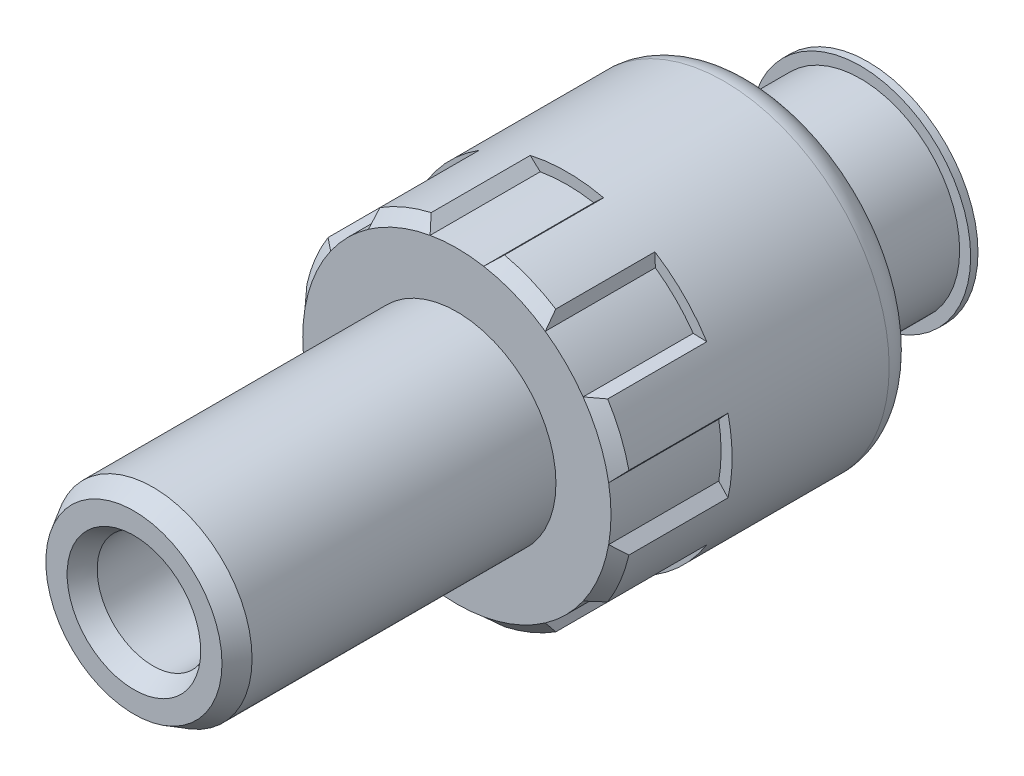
ISO-10303-21;
HEADER;
FILE_DESCRIPTION(('STEP AP214'),'2;1');
FILE_NAME('part.step','',(''),(''),'','','');
FILE_SCHEMA(('AUTOMOTIVE_DESIGN { 1 0 10303 214 1 1 1 1 }'));
ENDSEC;
DATA;
#1=APPLICATION_CONTEXT('core data for automotive mechanical design processes');
#2=APPLICATION_PROTOCOL_DEFINITION('international standard','automotive_design',2000,#1);
#3=PRODUCT_CONTEXT('',#1,'mechanical');
#4=PRODUCT('Part','Part','',(#3));
#5=PRODUCT_RELATED_PRODUCT_CATEGORY('part','',(#4));
#6=PRODUCT_DEFINITION_FORMATION('','',#4);
#7=PRODUCT_DEFINITION_CONTEXT('part definition',#1,'design');
#8=PRODUCT_DEFINITION('design','',#6,#7);
#9=PRODUCT_DEFINITION_SHAPE('','',#8);
#10=(LENGTH_UNIT() NAMED_UNIT(*) SI_UNIT(.MILLI.,.METRE.));
#11=(NAMED_UNIT(*) PLANE_ANGLE_UNIT() SI_UNIT($,.RADIAN.));
#12=(NAMED_UNIT(*) SI_UNIT($,.STERADIAN.) SOLID_ANGLE_UNIT());
#13=UNCERTAINTY_MEASURE_WITH_UNIT(LENGTH_MEASURE(1.E-05),#10,'distance_accuracy_value','');
#14=(GEOMETRIC_REPRESENTATION_CONTEXT(3) GLOBAL_UNCERTAINTY_ASSIGNED_CONTEXT((#13)) GLOBAL_UNIT_ASSIGNED_CONTEXT((#10,
#11,#12)) REPRESENTATION_CONTEXT('',''));
#15=CARTESIAN_POINT('',(0.,0.,0.));
#16=DIRECTION('',(0.,0.,1.));
#17=DIRECTION('',(1.,0.,0.));
#18=AXIS2_PLACEMENT_3D('',#15,#16,#17);
#19=CARTESIAN_POINT('',(0.,3.175,-17.4752));
#20=DIRECTION('',(0.,0.,1.));
#21=DIRECTION('',(1.,0.,0.));
#22=AXIS2_PLACEMENT_3D('',#19,#20,#21);
#23=PLANE('',#22);
#24=CARTESIAN_POINT('',(0.,0.,-17.4752));
#25=DIRECTION('',(0.,0.,1.));
#26=DIRECTION('',(1.,0.,0.));
#27=AXIS2_PLACEMENT_3D('',#24,#25,#26);
#28=CIRCLE('',#27,3.175);
#29=CARTESIAN_POINT('',(3.175,0.,-17.4752));
#30=VERTEX_POINT('',#29);
#31=EDGE_CURVE('E669',#30,#30,#28,.T.);
#32=ORIENTED_EDGE('',*,*,#31,.F.);
#33=EDGE_LOOP('',(#32));
#34=FACE_BOUND('',#33,.T.);
#35=CARTESIAN_POINT('',(0.,0.,-17.4752));
#36=DIRECTION('',(0.,0.,1.));
#37=DIRECTION('',(1.,0.,0.));
#38=AXIS2_PLACEMENT_3D('',#35,#36,#37);
#39=CIRCLE('',#38,3.10669546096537);
#40=CARTESIAN_POINT('',(3.10669546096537,0.,-17.4752));
#41=VERTEX_POINT('',#40);
#42=EDGE_CURVE('E11',#41,#41,#39,.F.);
#43=ORIENTED_EDGE('',*,*,#42,.F.);
#44=EDGE_LOOP('',(#43));
#45=FACE_BOUND('',#44,.T.);
#46=ADVANCED_FACE('F45',(#34,#45),#23,.F.);
#47=CARTESIAN_POINT('',(0.,0.,-11.557));
#48=DIRECTION('',(0.,0.,-1.));
#49=DIRECTION('',(-1.,0.,0.));
#50=AXIS2_PLACEMENT_3D('',#47,#48,#49);
#51=CONICAL_SURFACE('',#50,5.715,0.78539816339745);
#52=CARTESIAN_POINT('',(0.,0.,-11.176));
#53=DIRECTION('',(0.,0.,1.));
#54=DIRECTION('',(1.,0.,0.));
#55=AXIS2_PLACEMENT_3D('',#52,#53,#54);
#56=CIRCLE('',#55,5.334);
#57=CARTESIAN_POINT('',(-4.36935700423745,3.05945671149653,-11.176));
#58=VERTEX_POINT('',#57);
#59=CARTESIAN_POINT('',(-5.25296455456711,0.926239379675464,-11.176));
#60=VERTEX_POINT('',#59);
#61=EDGE_CURVE('E645',#58,#60,#56,.T.);
#62=ORIENTED_EDGE('',*,*,#61,.F.);
#63=CARTESIAN_POINT('',(-4.36915700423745,3.05946414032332,-11.1758404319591));
#64=CARTESIAN_POINT('',(-4.44790023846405,3.05653929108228,-11.2387131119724));
#65=CARTESIAN_POINT('',(-4.52636688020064,3.05362471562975,-11.3019265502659));
#66=CARTESIAN_POINT('',(-4.68274687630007,3.04781611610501,-11.4290348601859));
#67=CARTESIAN_POINT('',(-4.76066023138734,3.0449220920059,-11.49292973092));
#68=CARTESIAN_POINT('',(-4.83829699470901,3.04203834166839,-11.5571653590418));
#69=B_SPLINE_CURVE_WITH_KNOTS('',3,(#63,#64,#65,#66,#67,#68),.UNSPECIFIED.,.F.,.F.,(4,2,4),(0.,
0.302412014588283,0.604823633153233),.UNSPECIFIED.);
#70=CARTESIAN_POINT('',(-4.83809699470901,3.04204577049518,-11.557));
#71=VERTEX_POINT('',#70);
#72=EDGE_CURVE('E307',#58,#71,#69,.T.);
#73=ORIENTED_EDGE('',*,*,#72,.T.);
#74=CARTESIAN_POINT('',(0.,0.,-11.557));
#75=DIRECTION('',(0.,0.,1.));
#76=DIRECTION('',(1.,0.,0.));
#77=AXIS2_PLACEMENT_3D('',#74,#75,#76);
#78=CIRCLE('',#77,5.715);
#79=CARTESIAN_POINT('',(-5.572102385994,1.27,-11.557));
#80=VERTEX_POINT('',#79);
#81=EDGE_CURVE('E638',#71,#80,#78,.T.);
#82=ORIENTED_EDGE('',*,*,#81,.T.);
#83=CARTESIAN_POINT('',(-5.57226707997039,1.27017740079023,-11.5572));
#84=CARTESIAN_POINT('',(-5.5193983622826,1.21322964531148,-11.4929515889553));
#85=CARTESIAN_POINT('',(-5.46634125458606,1.15607896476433,-11.4290440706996));
#86=CARTESIAN_POINT('',(-5.35985018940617,1.04137167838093,-11.3019107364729));
#87=CARTESIAN_POINT('',(-5.3064162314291,0.983815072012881,-11.2386849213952));
#88=CARTESIAN_POINT('',(-5.25279388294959,0.926055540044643,-11.1758));
#89=B_SPLINE_CURVE_WITH_KNOTS('',3,(#83,#84,#85,#86,#87,#88),.UNSPECIFIED.,.F.,.F.,(4,2,4),(0.,
0.302471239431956,0.604942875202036),.UNSPECIFIED.);
#90=EDGE_CURVE('E350',#80,#60,#89,.T.);
#91=ORIENTED_EDGE('',*,*,#90,.T.);
#92=EDGE_LOOP('',(#62,#73,#82,#91));
#93=FACE_BOUND('',#92,.T.);
#94=ADVANCED_FACE('F736',(#93),#51,.T.);
#95=CARTESIAN_POINT('',(-5.25296455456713,-0.926239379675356,-11.176));
#96=VERTEX_POINT('',#95);
#97=CARTESIAN_POINT('',(-4.36935700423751,-3.05945671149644,-11.176));
#98=VERTEX_POINT('',#97);
#99=EDGE_CURVE('E1443',#96,#98,#56,.T.);
#100=ORIENTED_EDGE('',*,*,#99,.F.);
#101=CARTESIAN_POINT('',(-5.25279388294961,-0.926055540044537,-11.1758));
#102=CARTESIAN_POINT('',(-5.30641623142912,-0.983815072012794,-11.2386849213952));
#103=CARTESIAN_POINT('',(-5.35985018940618,-1.04137167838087,-11.3019107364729));
#104=CARTESIAN_POINT('',(-5.46634125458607,-1.1560789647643,-11.4290440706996));
#105=CARTESIAN_POINT('',(-5.5193983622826,-1.21322964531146,-11.4929515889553));
#106=CARTESIAN_POINT('',(-5.57226707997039,-1.27017740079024,-11.5572));
#107=B_SPLINE_CURVE_WITH_KNOTS('',3,(#101,#102,#103,#104,#105,#106),.UNSPECIFIED.,.F.,.F.,(4,2,
4),(0.,0.302471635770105,0.604942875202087),.UNSPECIFIED.);
#108=CARTESIAN_POINT('',(-5.572102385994,-1.27,-11.557));
#109=VERTEX_POINT('',#108);
#110=EDGE_CURVE('E340',#96,#109,#107,.T.);
#111=ORIENTED_EDGE('',*,*,#110,.T.);
#112=CARTESIAN_POINT('',(-4.83809699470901,-3.04204577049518,-11.557));
#113=VERTEX_POINT('',#112);
#114=EDGE_CURVE('E1387',#109,#113,#78,.T.);
#115=ORIENTED_EDGE('',*,*,#114,.T.);
#116=CARTESIAN_POINT('',(-4.83829699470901,-3.04203834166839,-11.5571653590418));
#117=CARTESIAN_POINT('',(-4.76066023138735,-3.04492209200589,-11.49292973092));
#118=CARTESIAN_POINT('',(-4.68274687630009,-3.04781611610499,-11.4290348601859));
#119=CARTESIAN_POINT('',(-4.52636688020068,-3.05362471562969,-11.3019265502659));
#120=CARTESIAN_POINT('',(-4.44790023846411,-3.05653929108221,-11.2387131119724));
#121=CARTESIAN_POINT('',(-4.36915700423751,-3.05946414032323,-11.1758404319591));
#122=B_SPLINE_CURVE_WITH_KNOTS('',3,(#116,#117,#118,#119,#120,#121),.UNSPECIFIED.,.F.,.F.,(4,2,
4),(0.,0.302411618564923,0.604823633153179),.UNSPECIFIED.);
#123=EDGE_CURVE('E378',#113,#98,#122,.T.);
#124=ORIENTED_EDGE('',*,*,#123,.T.);
#125=EDGE_LOOP('',(#100,#111,#115,#124));
#126=FACE_BOUND('',#125,.T.);
#127=ADVANCED_FACE('F1016',(#126),#51,.T.);
#128=CARTESIAN_POINT('',(-3.05945671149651,-4.36935700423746,-11.176));
#129=VERTEX_POINT('',#128);
#130=CARTESIAN_POINT('',(-0.926239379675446,-5.25296455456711,-11.176));
#131=VERTEX_POINT('',#130);
#132=EDGE_CURVE('E1448',#129,#131,#56,.T.);
#133=ORIENTED_EDGE('',*,*,#132,.F.);
#134=CARTESIAN_POINT('',(-3.05946414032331,-4.36915700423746,-11.1758404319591));
#135=CARTESIAN_POINT('',(-3.05653929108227,-4.44790023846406,-11.2387131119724));
#136=CARTESIAN_POINT('',(-3.05362471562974,-4.52636688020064,-11.3019265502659));
#137=CARTESIAN_POINT('',(-3.04781611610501,-4.68274687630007,-11.4290348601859));
#138=CARTESIAN_POINT('',(-3.0449220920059,-4.76066023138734,-11.49292973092));
#139=CARTESIAN_POINT('',(-3.04203834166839,-4.83829699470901,-11.5571653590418));
#140=B_SPLINE_CURVE_WITH_KNOTS('',3,(#134,#135,#136,#137,#138,#139),.UNSPECIFIED.,.F.,.F.,(4,2,
4),(0.,0.302412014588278,0.604823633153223),.UNSPECIFIED.);
#141=CARTESIAN_POINT('',(-3.04204577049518,-4.83809699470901,-11.557));
#142=VERTEX_POINT('',#141);
#143=EDGE_CURVE('E397',#129,#142,#140,.T.);
#144=ORIENTED_EDGE('',*,*,#143,.T.);
#145=CARTESIAN_POINT('',(-1.27,-5.572102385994,-11.557));
#146=VERTEX_POINT('',#145);
#147=EDGE_CURVE('E1382',#142,#146,#78,.T.);
#148=ORIENTED_EDGE('',*,*,#147,.T.);
#149=CARTESIAN_POINT('',(-1.27017740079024,-5.57226707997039,-11.5572));
#150=CARTESIAN_POINT('',(-1.21322964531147,-5.5193983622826,-11.4929515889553));
#151=CARTESIAN_POINT('',(-1.15607896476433,-5.46634125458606,-11.4290440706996));
#152=CARTESIAN_POINT('',(-1.04137167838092,-5.35985018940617,-11.3019107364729));
#153=CARTESIAN_POINT('',(-0.983815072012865,-5.3064162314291,-11.2386849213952));
#154=CARTESIAN_POINT('',(-0.926055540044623,-5.25279388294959,-11.1758));
#155=B_SPLINE_CURVE_WITH_KNOTS('',3,(#149,#150,#151,#152,#153,#154),.UNSPECIFIED.,.F.,.F.,(4,2,
4),(0.,0.302471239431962,0.604942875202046),.UNSPECIFIED.);
#156=EDGE_CURVE('E441',#146,#131,#155,.T.);
#157=ORIENTED_EDGE('',*,*,#156,.T.);
#158=EDGE_LOOP('',(#133,#144,#148,#157));
#159=FACE_BOUND('',#158,.T.);
#160=ADVANCED_FACE('F1026',(#159),#51,.T.);
#161=CARTESIAN_POINT('',(0.926239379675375,-5.25296455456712,-11.176));
#162=VERTEX_POINT('',#161);
#163=CARTESIAN_POINT('',(3.05945671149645,-4.3693570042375,-11.176));
#164=VERTEX_POINT('',#163);
#165=EDGE_CURVE('E1451',#162,#164,#56,.T.);
#166=ORIENTED_EDGE('',*,*,#165,.F.);
#167=CARTESIAN_POINT('',(0.926055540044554,-5.2527938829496,-11.1758));
#168=CARTESIAN_POINT('',(0.983815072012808,-5.30641623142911,-11.2386849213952));
#169=CARTESIAN_POINT('',(1.04137167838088,-5.35985018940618,-11.3019107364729));
#170=CARTESIAN_POINT('',(1.1560789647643,-5.46634125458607,-11.4290440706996));
#171=CARTESIAN_POINT('',(1.21322964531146,-5.5193983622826,-11.4929515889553));
#172=CARTESIAN_POINT('',(1.27017740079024,-5.57226707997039,-11.5572));
#173=B_SPLINE_CURVE_WITH_KNOTS('',3,(#167,#168,#169,#170,#171,#172),.UNSPECIFIED.,.F.,.F.,(4,2,
4),(0.,0.3024716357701,0.604942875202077),.UNSPECIFIED.);
#174=CARTESIAN_POINT('',(1.27,-5.572102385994,-11.557));
#175=VERTEX_POINT('',#174);
#176=EDGE_CURVE('E431',#162,#175,#173,.T.);
#177=ORIENTED_EDGE('',*,*,#176,.T.);
#178=CARTESIAN_POINT('',(3.04204577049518,-4.83809699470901,-11.557));
#179=VERTEX_POINT('',#178);
#180=EDGE_CURVE('E1375',#175,#179,#78,.T.);
#181=ORIENTED_EDGE('',*,*,#180,.T.);
#182=CARTESIAN_POINT('',(3.04203834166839,-4.83829699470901,-11.5571653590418));
#183=CARTESIAN_POINT('',(3.04492209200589,-4.76066023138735,-11.49292973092));
#184=CARTESIAN_POINT('',(3.04781611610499,-4.68274687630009,-11.4290348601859));
#185=CARTESIAN_POINT('',(3.0536247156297,-4.52636688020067,-11.3019265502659));
#186=CARTESIAN_POINT('',(3.05653929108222,-4.4479002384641,-11.2387131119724));
#187=CARTESIAN_POINT('',(3.05946414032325,-4.3691570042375,-11.1758404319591));
#188=B_SPLINE_CURVE_WITH_KNOTS('',3,(#182,#183,#184,#185,#186,#187),.UNSPECIFIED.,.F.,.F.,(4,2,
4),(0.,0.302411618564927,0.604823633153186),.UNSPECIFIED.);
#189=EDGE_CURVE('E469',#179,#164,#188,.T.);
#190=ORIENTED_EDGE('',*,*,#189,.T.);
#191=EDGE_LOOP('',(#166,#177,#181,#190));
#192=FACE_BOUND('',#191,.T.);
#193=ADVANCED_FACE('F1035',(#192),#51,.T.);
#194=CARTESIAN_POINT('',(4.36935700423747,-3.0594567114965,-11.176));
#195=VERTEX_POINT('',#194);
#196=CARTESIAN_POINT('',(5.25296455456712,-0.926239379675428,-11.176));
#197=VERTEX_POINT('',#196);
#198=EDGE_CURVE('E1457',#195,#197,#56,.T.);
#199=ORIENTED_EDGE('',*,*,#198,.F.);
#200=CARTESIAN_POINT('',(4.36915700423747,-3.05946414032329,-11.1758404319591));
#201=CARTESIAN_POINT('',(4.44790023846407,-3.05653929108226,-11.2387131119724));
#202=CARTESIAN_POINT('',(4.52636688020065,-3.05362471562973,-11.3019265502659));
#203=CARTESIAN_POINT('',(4.68274687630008,-3.047816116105,-11.4290348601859));
#204=CARTESIAN_POINT('',(4.76066023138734,-3.0449220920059,-11.49292973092));
#205=CARTESIAN_POINT('',(4.83829699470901,-3.04203834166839,-11.5571653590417));
#206=B_SPLINE_CURVE_WITH_KNOTS('',3,(#200,#201,#202,#203,#204,#205),.UNSPECIFIED.,.F.,.F.,(4,2,
4),(0.,0.302412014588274,0.604823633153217),.UNSPECIFIED.);
#207=CARTESIAN_POINT('',(4.83809699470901,-3.04204577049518,-11.557));
#208=VERTEX_POINT('',#207);
#209=EDGE_CURVE('E488',#195,#208,#206,.T.);
#210=ORIENTED_EDGE('',*,*,#209,.T.);
#211=CARTESIAN_POINT('',(5.572102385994,-1.27,-11.557));
#212=VERTEX_POINT('',#211);
#213=EDGE_CURVE('E1370',#208,#212,#78,.T.);
#214=ORIENTED_EDGE('',*,*,#213,.T.);
#215=CARTESIAN_POINT('',(5.57226707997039,-1.27017740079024,-11.5572));
#216=CARTESIAN_POINT('',(5.5193983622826,-1.21322964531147,-11.4929515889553));
#217=CARTESIAN_POINT('',(5.46634125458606,-1.15607896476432,-11.4290440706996));
#218=CARTESIAN_POINT('',(5.35985018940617,-1.04137167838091,-11.3019107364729));
#219=CARTESIAN_POINT('',(5.30641623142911,-0.983815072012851,-11.2386849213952));
#220=CARTESIAN_POINT('',(5.25279388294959,-0.926055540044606,-11.1758));
#221=B_SPLINE_CURVE_WITH_KNOTS('',3,(#215,#216,#217,#218,#219,#220),.UNSPECIFIED.,.F.,.F.,(4,2,
4),(0.,0.302471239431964,0.604942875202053),.UNSPECIFIED.);
#222=EDGE_CURVE('E532',#212,#197,#221,.T.);
#223=ORIENTED_EDGE('',*,*,#222,.T.);
#224=EDGE_LOOP('',(#199,#210,#214,#223));
#225=FACE_BOUND('',#224,.T.);
#226=ADVANCED_FACE('F1044',(#225),#51,.T.);
#227=CARTESIAN_POINT('',(5.25296455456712,0.926239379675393,-11.176));
#228=VERTEX_POINT('',#227);
#229=CARTESIAN_POINT('',(4.36935700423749,3.05945671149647,-11.176));
#230=VERTEX_POINT('',#229);
#231=EDGE_CURVE('E1462',#228,#230,#56,.T.);
#232=ORIENTED_EDGE('',*,*,#231,.F.);
#233=CARTESIAN_POINT('',(5.2527938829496,0.926055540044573,-11.1758));
#234=CARTESIAN_POINT('',(5.30641623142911,0.983815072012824,-11.2386849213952));
#235=CARTESIAN_POINT('',(5.35985018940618,1.04137167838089,-11.3019107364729));
#236=CARTESIAN_POINT('',(5.46634125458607,1.15607896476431,-11.4290440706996));
#237=CARTESIAN_POINT('',(5.5193983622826,1.21322964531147,-11.4929515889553));
#238=CARTESIAN_POINT('',(5.57226707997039,1.27017740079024,-11.5572));
#239=B_SPLINE_CURVE_WITH_KNOTS('',3,(#233,#234,#235,#236,#237,#238),.UNSPECIFIED.,.F.,.F.,(4,2,
4),(0.,0.302471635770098,0.604942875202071),.UNSPECIFIED.);
#240=CARTESIAN_POINT('',(5.572102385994,1.27,-11.557));
#241=VERTEX_POINT('',#240);
#242=EDGE_CURVE('E522',#228,#241,#239,.T.);
#243=ORIENTED_EDGE('',*,*,#242,.T.);
#244=CARTESIAN_POINT('',(4.83809699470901,3.04204577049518,-11.557));
#245=VERTEX_POINT('',#244);
#246=EDGE_CURVE('E1367',#241,#245,#78,.T.);
#247=ORIENTED_EDGE('',*,*,#246,.T.);
#248=CARTESIAN_POINT('',(4.83829699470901,3.04203834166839,-11.5571653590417));
#249=CARTESIAN_POINT('',(4.76066023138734,3.04492209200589,-11.49292973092));
#250=CARTESIAN_POINT('',(4.68274687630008,3.047816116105,-11.4290348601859));
#251=CARTESIAN_POINT('',(4.52636688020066,3.05362471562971,-11.3019265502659));
#252=CARTESIAN_POINT('',(4.44790023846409,3.05653929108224,-11.2387131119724));
#253=CARTESIAN_POINT('',(4.36915700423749,3.05946414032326,-11.1758404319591));
#254=B_SPLINE_CURVE_WITH_KNOTS('',3,(#248,#249,#250,#251,#252,#253),.UNSPECIFIED.,.F.,.F.,(4,2,
4),(0.,0.302411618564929,0.604823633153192),.UNSPECIFIED.);
#255=EDGE_CURVE('E560',#245,#230,#254,.T.);
#256=ORIENTED_EDGE('',*,*,#255,.T.);
#257=EDGE_LOOP('',(#232,#243,#247,#256));
#258=FACE_BOUND('',#257,.T.);
#259=ADVANCED_FACE('F1053',(#258),#51,.T.);
#260=CARTESIAN_POINT('',(3.05945671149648,4.36935700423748,-11.176));
#261=VERTEX_POINT('',#260);
#262=CARTESIAN_POINT('',(0.926239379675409,5.25296455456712,-11.176));
#263=VERTEX_POINT('',#262);
#264=EDGE_CURVE('E637',#261,#263,#56,.T.);
#265=ORIENTED_EDGE('',*,*,#264,.F.);
#266=CARTESIAN_POINT('',(3.05946414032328,4.36915700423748,-11.1758404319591));
#267=CARTESIAN_POINT('',(3.05653929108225,4.44790023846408,-11.2387131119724));
#268=CARTESIAN_POINT('',(3.05362471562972,4.52636688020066,-11.3019265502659));
#269=CARTESIAN_POINT('',(3.047816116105,4.68274687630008,-11.4290348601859));
#270=CARTESIAN_POINT('',(3.0449220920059,4.76066023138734,-11.49292973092));
#271=CARTESIAN_POINT('',(3.04203834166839,4.83829699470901,-11.5571653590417));
#272=B_SPLINE_CURVE_WITH_KNOTS('',3,(#266,#267,#268,#269,#270,#271),.UNSPECIFIED.,.F.,.F.,(4,2,
4),(0.,0.302412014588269,0.604823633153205),.UNSPECIFIED.);
#273=CARTESIAN_POINT('',(3.04204577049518,4.83809699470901,-11.557));
#274=VERTEX_POINT('',#273);
#275=EDGE_CURVE('E579',#261,#274,#272,.T.);
#276=ORIENTED_EDGE('',*,*,#275,.T.);
#277=CARTESIAN_POINT('',(1.27,5.572102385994,-11.557));
#278=VERTEX_POINT('',#277);
#279=EDGE_CURVE('E632',#274,#278,#78,.T.);
#280=ORIENTED_EDGE('',*,*,#279,.T.);
#281=CARTESIAN_POINT('',(1.27017740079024,5.57226707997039,-11.5572));
#282=CARTESIAN_POINT('',(1.21322964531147,5.5193983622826,-11.4929515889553));
#283=CARTESIAN_POINT('',(1.15607896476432,5.46634125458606,-11.4290440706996));
#284=CARTESIAN_POINT('',(1.0413716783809,5.35985018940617,-11.3019107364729));
#285=CARTESIAN_POINT('',(0.983815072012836,5.30641623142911,-11.2386849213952));
#286=CARTESIAN_POINT('',(0.926055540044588,5.2527938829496,-11.1758));
#287=B_SPLINE_CURVE_WITH_KNOTS('',3,(#281,#282,#283,#284,#285,#286),.UNSPECIFIED.,.F.,.F.,(4,2,
4),(0.,0.30247123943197,0.604942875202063),.UNSPECIFIED.);
#288=EDGE_CURVE('E623',#278,#263,#287,.T.);
#289=ORIENTED_EDGE('',*,*,#288,.T.);
#290=EDGE_LOOP('',(#265,#276,#280,#289));
#291=FACE_BOUND('',#290,.T.);
#292=ADVANCED_FACE('F1062',(#291),#51,.T.);
#293=CARTESIAN_POINT('',(0.,0.,-20.4216));
#294=DIRECTION('',(0.,0.,1.));
#295=DIRECTION('',(1.,0.,0.));
#296=AXIS2_PLACEMENT_3D('',#293,#294,#295);
#297=TOROIDAL_SURFACE('',#296,4.699,1.016);
#298=CARTESIAN_POINT('',(0.,0.,-20.4216));
#299=DIRECTION('',(0.,0.,1.));
#300=DIRECTION('',(1.,0.,0.));
#301=AXIS2_PLACEMENT_3D('',#298,#299,#300);
#302=CIRCLE('',#301,5.715);
#303=CARTESIAN_POINT('',(5.715,0.,-20.4216));
#304=VERTEX_POINT('',#303);
#305=EDGE_CURVE('E622',#304,#304,#302,.T.);
#306=ORIENTED_EDGE('',*,*,#305,.F.);
#307=EDGE_LOOP('',(#306));
#308=FACE_BOUND('',#307,.T.);
#309=CARTESIAN_POINT('',(0.,0.,-21.4376));
#310=DIRECTION('',(0.,0.,1.));
#311=DIRECTION('',(1.,0.,0.));
#312=AXIS2_PLACEMENT_3D('',#309,#310,#311);
#313=CIRCLE('',#312,4.69899999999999);
#314=CARTESIAN_POINT('',(4.69899999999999,0.,-21.4376));
#315=VERTEX_POINT('',#314);
#316=EDGE_CURVE('E54',#315,#315,#313,.T.);
#317=ORIENTED_EDGE('',*,*,#316,.T.);
#318=EDGE_LOOP('',(#317));
#319=FACE_BOUND('',#318,.T.);
#320=ADVANCED_FACE('F47',(#308,#319),#297,.T.);
#321=CARTESIAN_POINT('',(0.,3.429,-21.4376));
#322=DIRECTION('',(0.,0.,1.));
#323=DIRECTION('',(1.,0.,0.));
#324=AXIS2_PLACEMENT_3D('',#321,#322,#323);
#325=PLANE('',#324);
#326=ORIENTED_EDGE('',*,*,#316,.F.);
#327=EDGE_LOOP('',(#326));
#328=FACE_BOUND('',#327,.T.);
#329=CARTESIAN_POINT('',(0.,0.,-21.4376));
#330=DIRECTION('',(0.,0.,1.));
#331=DIRECTION('',(1.,0.,0.));
#332=AXIS2_PLACEMENT_3D('',#329,#330,#331);
#333=CIRCLE('',#332,3.429);
#334=CARTESIAN_POINT('',(3.429,0.,-21.4376));
#335=VERTEX_POINT('',#334);
#336=EDGE_CURVE('E689',#335,#335,#333,.T.);
#337=ORIENTED_EDGE('',*,*,#336,.T.);
#338=EDGE_LOOP('',(#337));
#339=FACE_BOUND('',#338,.T.);
#340=ADVANCED_FACE('F698',(#328,#339),#325,.F.);
#341=CARTESIAN_POINT('',(0.,0.,0.));
#342=DIRECTION('',(0.,0.,1.));
#343=DIRECTION('',(1.,0.,0.));
#344=AXIS2_PLACEMENT_3D('',#341,#342,#343);
#345=CYLINDRICAL_SURFACE('',#344,3.429);
#346=ORIENTED_EDGE('',*,*,#336,.F.);
#347=EDGE_LOOP('',(#346));
#348=FACE_BOUND('',#347,.T.);
#349=CARTESIAN_POINT('',(0.,0.,-25.146));
#350=DIRECTION('',(0.,0.,1.));
#351=DIRECTION('',(1.,0.,0.));
#352=AXIS2_PLACEMENT_3D('',#349,#350,#351);
#353=CIRCLE('',#352,3.429);
#354=CARTESIAN_POINT('',(3.429,0.,-25.146));
#355=VERTEX_POINT('',#354);
#356=EDGE_CURVE('E685',#355,#355,#353,.T.);
#357=ORIENTED_EDGE('',*,*,#356,.T.);
#358=EDGE_LOOP('',(#357));
#359=FACE_BOUND('',#358,.T.);
#360=ADVANCED_FACE('F701',(#348,#359),#345,.T.);
#361=CARTESIAN_POINT('',(0.,3.81,-25.146));
#362=DIRECTION('',(0.,0.,-1.));
#363=DIRECTION('',(-1.,0.,0.));
#364=AXIS2_PLACEMENT_3D('',#361,#362,#363);
#365=PLANE('',#364);
#366=ORIENTED_EDGE('',*,*,#356,.F.);
#367=EDGE_LOOP('',(#366));
#368=FACE_BOUND('',#367,.T.);
#369=CARTESIAN_POINT('',(0.,0.,-25.146));
#370=DIRECTION('',(0.,0.,1.));
#371=DIRECTION('',(1.,0.,0.));
#372=AXIS2_PLACEMENT_3D('',#369,#370,#371);
#373=CIRCLE('',#372,3.81);
#374=CARTESIAN_POINT('',(3.81,0.,-25.146));
#375=VERTEX_POINT('',#374);
#376=EDGE_CURVE('E681',#375,#375,#373,.T.);
#377=ORIENTED_EDGE('',*,*,#376,.T.);
#378=EDGE_LOOP('',(#377));
#379=FACE_BOUND('',#378,.T.);
#380=ADVANCED_FACE('F706',(#368,#379),#365,.F.);
#381=CARTESIAN_POINT('',(0.,0.,0.));
#382=DIRECTION('',(0.,0.,1.));
#383=DIRECTION('',(1.,0.,0.));
#384=AXIS2_PLACEMENT_3D('',#381,#382,#383);
#385=CYLINDRICAL_SURFACE('',#384,3.81);
#386=ORIENTED_EDGE('',*,*,#376,.F.);
#387=EDGE_LOOP('',(#386));
#388=FACE_BOUND('',#387,.T.);
#389=CARTESIAN_POINT('',(0.,0.,-25.4));
#390=DIRECTION('',(0.,0.,1.));
#391=DIRECTION('',(1.,0.,0.));
#392=AXIS2_PLACEMENT_3D('',#389,#390,#391);
#393=CIRCLE('',#392,3.81);
#394=CARTESIAN_POINT('',(3.81,0.,-25.4));
#395=VERTEX_POINT('',#394);
#396=EDGE_CURVE('E677',#395,#395,#393,.T.);
#397=ORIENTED_EDGE('',*,*,#396,.T.);
#398=EDGE_LOOP('',(#397));
#399=FACE_BOUND('',#398,.T.);
#400=ADVANCED_FACE('F712',(#388,#399),#385,.T.);
#401=CARTESIAN_POINT('',(0.,3.81,-25.4));
#402=DIRECTION('',(0.,0.,1.));
#403=DIRECTION('',(1.,0.,0.));
#404=AXIS2_PLACEMENT_3D('',#401,#402,#403);
#405=PLANE('',#404);
#406=ORIENTED_EDGE('',*,*,#396,.F.);
#407=EDGE_LOOP('',(#406));
#408=FACE_BOUND('',#407,.T.);
#409=CARTESIAN_POINT('',(0.,0.,-25.4));
#410=DIRECTION('',(0.,0.,1.));
#411=DIRECTION('',(1.,0.,0.));
#412=AXIS2_PLACEMENT_3D('',#409,#410,#411);
#413=CIRCLE('',#412,3.175);
#414=CARTESIAN_POINT('',(3.175,0.,-25.4));
#415=VERTEX_POINT('',#414);
#416=EDGE_CURVE('E673',#415,#415,#413,.T.);
#417=ORIENTED_EDGE('',*,*,#416,.T.);
#418=EDGE_LOOP('',(#417));
#419=FACE_BOUND('',#418,.T.);
#420=ADVANCED_FACE('F718',(#408,#419),#405,.F.);
#421=CARTESIAN_POINT('',(0.,0.,0.));
#422=DIRECTION('',(0.,0.,1.));
#423=DIRECTION('',(1.,0.,0.));
#424=AXIS2_PLACEMENT_3D('',#421,#422,#423);
#425=CYLINDRICAL_SURFACE('',#424,3.175);
#426=ORIENTED_EDGE('',*,*,#416,.F.);
#427=EDGE_LOOP('',(#426));
#428=FACE_BOUND('',#427,.T.);
#429=ORIENTED_EDGE('',*,*,#31,.T.);
#430=EDGE_LOOP('',(#429));
#431=FACE_BOUND('',#430,.T.);
#432=ADVANCED_FACE('F724',(#428,#431),#425,.F.);
#433=CARTESIAN_POINT('',(0.,0.,0.));
#434=DIRECTION('',(0.,0.,1.));
#435=DIRECTION('',(1.,0.,0.));
#436=AXIS2_PLACEMENT_3D('',#433,#434,#435);
#437=CYLINDRICAL_SURFACE('',#436,1.9304);
#438=CARTESIAN_POINT('',(0.,0.,-17.4752));
#439=DIRECTION('',(0.,0.,1.));
#440=DIRECTION('',(1.,0.,0.));
#441=AXIS2_PLACEMENT_3D('',#438,#439,#440);
#442=CIRCLE('',#441,1.9304);
#443=CARTESIAN_POINT('',(1.9304,0.,-17.4752));
#444=VERTEX_POINT('',#443);
#445=EDGE_CURVE('E665',#444,#444,#442,.T.);
#446=ORIENTED_EDGE('',*,*,#445,.F.);
#447=EDGE_LOOP('',(#446));
#448=FACE_BOUND('',#447,.T.);
#449=CARTESIAN_POINT('',(0.,0.,-0.659911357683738));
#450=DIRECTION('',(0.,0.,1.));
#451=DIRECTION('',(1.,0.,0.));
#452=AXIS2_PLACEMENT_3D('',#449,#450,#451);
#453=CIRCLE('',#452,1.9304);
#454=CARTESIAN_POINT('',(1.9304,0.,-0.659911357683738));
#455=VERTEX_POINT('',#454);
#456=EDGE_CURVE('E661',#455,#455,#453,.T.);
#457=ORIENTED_EDGE('',*,*,#456,.T.);
#458=EDGE_LOOP('',(#457));
#459=FACE_BOUND('',#458,.T.);
#460=ADVANCED_FACE('F730',(#448,#459),#437,.F.);
#461=CARTESIAN_POINT('',(0.,0.,0.));
#462=DIRECTION('',(0.,0.,1.));
#463=DIRECTION('',(1.,0.,0.));
#464=AXIS2_PLACEMENT_3D('',#461,#462,#463);
#465=CONICAL_SURFACE('',#464,2.3114,0.523598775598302);
#466=ORIENTED_EDGE('',*,*,#456,.F.);
#467=EDGE_LOOP('',(#466));
#468=FACE_BOUND('',#467,.T.);
#469=CARTESIAN_POINT('',(0.,0.,0.));
#470=DIRECTION('',(0.,0.,1.));
#471=DIRECTION('',(1.,0.,0.));
#472=AXIS2_PLACEMENT_3D('',#469,#470,#471);
#473=CIRCLE('',#472,2.3114);
#474=CARTESIAN_POINT('',(2.3114,0.,0.));
#475=VERTEX_POINT('',#474);
#476=EDGE_CURVE('E657',#475,#475,#473,.T.);
#477=ORIENTED_EDGE('',*,*,#476,.T.);
#478=EDGE_LOOP('',(#477));
#479=FACE_BOUND('',#478,.T.);
#480=ADVANCED_FACE('F1123',(#468,#479),#465,.F.);
#481=CARTESIAN_POINT('',(0.,2.3114,0.));
#482=DIRECTION('',(0.,0.,-1.));
#483=DIRECTION('',(-1.,0.,0.));
#484=AXIS2_PLACEMENT_3D('',#481,#482,#483);
#485=PLANE('',#484);
#486=ORIENTED_EDGE('',*,*,#476,.F.);
#487=EDGE_LOOP('',(#486));
#488=FACE_BOUND('',#487,.T.);
#489=CARTESIAN_POINT('',(0.,0.,0.));
#490=DIRECTION('',(0.,0.,1.));
#491=DIRECTION('',(1.,0.,0.));
#492=AXIS2_PLACEMENT_3D('',#489,#490,#491);
#493=CIRCLE('',#492,3.048);
#494=CARTESIAN_POINT('',(3.048,0.,0.));
#495=VERTEX_POINT('',#494);
#496=EDGE_CURVE('E653',#495,#495,#493,.T.);
#497=ORIENTED_EDGE('',*,*,#496,.T.);
#498=EDGE_LOOP('',(#497));
#499=FACE_BOUND('',#498,.T.);
#500=ADVANCED_FACE('F1113',(#488,#499),#485,.F.);
#501=CARTESIAN_POINT('',(0.,0.,-0.659911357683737));
#502=DIRECTION('',(0.,0.,-1.));
#503=DIRECTION('',(-1.,0.,0.));
#504=AXIS2_PLACEMENT_3D('',#501,#502,#503);
#505=CONICAL_SURFACE('',#504,3.429,0.523598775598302);
#506=ORIENTED_EDGE('',*,*,#496,.F.);
#507=EDGE_LOOP('',(#506));
#508=FACE_BOUND('',#507,.T.);
#509=CARTESIAN_POINT('',(0.,0.,-0.659911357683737));
#510=DIRECTION('',(0.,0.,1.));
#511=DIRECTION('',(1.,0.,0.));
#512=AXIS2_PLACEMENT_3D('',#509,#510,#511);
#513=CIRCLE('',#512,3.429);
#514=CARTESIAN_POINT('',(3.429,0.,-0.659911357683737));
#515=VERTEX_POINT('',#514);
#516=EDGE_CURVE('E649',#515,#515,#513,.T.);
#517=ORIENTED_EDGE('',*,*,#516,.T.);
#518=EDGE_LOOP('',(#517));
#519=FACE_BOUND('',#518,.T.);
#520=ADVANCED_FACE('F1103',(#508,#519),#505,.T.);
#521=CARTESIAN_POINT('',(0.,0.,0.));
#522=DIRECTION('',(0.,0.,1.));
#523=DIRECTION('',(1.,0.,0.));
#524=AXIS2_PLACEMENT_3D('',#521,#522,#523);
#525=CYLINDRICAL_SURFACE('',#524,3.429);
#526=ORIENTED_EDGE('',*,*,#516,.F.);
#527=EDGE_LOOP('',(#526));
#528=FACE_BOUND('',#527,.T.);
#529=CARTESIAN_POINT('',(0.,0.,-11.176));
#530=DIRECTION('',(0.,0.,1.));
#531=DIRECTION('',(1.,0.,0.));
#532=AXIS2_PLACEMENT_3D('',#529,#530,#531);
#533=CIRCLE('',#532,3.429);
#534=CARTESIAN_POINT('',(3.429,0.,-11.176));
#535=VERTEX_POINT('',#534);
#536=EDGE_CURVE('E643',#535,#535,#533,.T.);
#537=ORIENTED_EDGE('',*,*,#536,.T.);
#538=EDGE_LOOP('',(#537));
#539=FACE_BOUND('',#538,.T.);
#540=ADVANCED_FACE('F1095',(#528,#539),#525,.T.);
#541=CARTESIAN_POINT('',(0.,3.429,-11.176));
#542=DIRECTION('',(0.,0.,-1.));
#543=DIRECTION('',(-1.,0.,0.));
#544=AXIS2_PLACEMENT_3D('',#541,#542,#543);
#545=PLANE('',#544);
#546=ORIENTED_EDGE('',*,*,#536,.F.);
#547=EDGE_LOOP('',(#546));
#548=FACE_BOUND('',#547,.T.);
#549=CARTESIAN_POINT('',(-0.926239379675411,5.25296455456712,-11.176));
#550=VERTEX_POINT('',#549);
#551=EDGE_CURVE('E639',#263,#550,#56,.T.);
#552=ORIENTED_EDGE('',*,*,#551,.T.);
#553=CARTESIAN_POINT('',(-3.05945671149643,4.36935700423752,-11.176));
#554=VERTEX_POINT('',#553);
#555=EDGE_CURVE('E644',#550,#554,#56,.T.);
#556=ORIENTED_EDGE('',*,*,#555,.T.);
#557=CARTESIAN_POINT('',(0.,0.,-11.176));
#558=DIRECTION('',(0.,0.,-1.));
#559=DIRECTION('',(1.,0.,0.));
#560=AXIS2_PLACEMENT_3D('',#557,#558,#559);
#561=CIRCLE('',#560,5.334);
#562=EDGE_CURVE('E263',#58,#554,#561,.T.);
#563=ORIENTED_EDGE('',*,*,#562,.F.);
#564=ORIENTED_EDGE('',*,*,#61,.T.);
#565=CARTESIAN_POINT('',(0.,0.,-11.176));
#566=DIRECTION('',(0.,0.,-1.));
#567=DIRECTION('',(1.,0.,0.));
#568=AXIS2_PLACEMENT_3D('',#565,#566,#567);
#569=CIRCLE('',#568,5.334);
#570=EDGE_CURVE('E1426',#96,#60,#569,.T.);
#571=ORIENTED_EDGE('',*,*,#570,.F.);
#572=ORIENTED_EDGE('',*,*,#99,.T.);
#573=CARTESIAN_POINT('',(0.,0.,-11.176));
#574=DIRECTION('',(0.,0.,-1.));
#575=DIRECTION('',(1.,0.,0.));
#576=AXIS2_PLACEMENT_3D('',#573,#574,#575);
#577=CIRCLE('',#576,5.334);
#578=EDGE_CURVE('E349',#129,#98,#577,.T.);
#579=ORIENTED_EDGE('',*,*,#578,.F.);
#580=ORIENTED_EDGE('',*,*,#132,.T.);
#581=CARTESIAN_POINT('',(0.,0.,-11.176));
#582=DIRECTION('',(0.,0.,-1.));
#583=DIRECTION('',(1.,0.,0.));
#584=AXIS2_PLACEMENT_3D('',#581,#582,#583);
#585=CIRCLE('',#584,5.334);
#586=EDGE_CURVE('E1643',#162,#131,#585,.T.);
#587=ORIENTED_EDGE('',*,*,#586,.F.);
#588=ORIENTED_EDGE('',*,*,#165,.T.);
#589=CARTESIAN_POINT('',(0.,0.,-11.176));
#590=DIRECTION('',(0.,0.,-1.));
#591=DIRECTION('',(1.,0.,0.));
#592=AXIS2_PLACEMENT_3D('',#589,#590,#591);
#593=CIRCLE('',#592,5.334);
#594=EDGE_CURVE('E440',#195,#164,#593,.T.);
#595=ORIENTED_EDGE('',*,*,#594,.F.);
#596=ORIENTED_EDGE('',*,*,#198,.T.);
#597=CARTESIAN_POINT('',(0.,0.,-11.176));
#598=DIRECTION('',(0.,0.,-1.));
#599=DIRECTION('',(1.,0.,0.));
#600=AXIS2_PLACEMENT_3D('',#597,#598,#599);
#601=CIRCLE('',#600,5.334);
#602=EDGE_CURVE('E1567',#228,#197,#601,.T.);
#603=ORIENTED_EDGE('',*,*,#602,.F.);
#604=ORIENTED_EDGE('',*,*,#231,.T.);
#605=CARTESIAN_POINT('',(0.,0.,-11.176));
#606=DIRECTION('',(0.,0.,-1.));
#607=DIRECTION('',(1.,0.,0.));
#608=AXIS2_PLACEMENT_3D('',#605,#606,#607);
#609=CIRCLE('',#608,5.334);
#610=EDGE_CURVE('E531',#261,#230,#609,.T.);
#611=ORIENTED_EDGE('',*,*,#610,.F.);
#612=ORIENTED_EDGE('',*,*,#264,.T.);
#613=EDGE_LOOP('',(#552,#556,#563,#564,#571,#572,#579,#580,#587,#588,#595,#596,#603,#604,#611,#612));
#614=FACE_BOUND('',#613,.T.);
#615=ADVANCED_FACE('F1087',(#548,#614),#545,.F.);
#616=CARTESIAN_POINT('',(-1.27,5.572102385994,-11.557));
#617=VERTEX_POINT('',#616);
#618=CARTESIAN_POINT('',(-3.04204577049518,4.83809699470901,-11.557));
#619=VERTEX_POINT('',#618);
#620=EDGE_CURVE('E633',#617,#619,#78,.T.);
#621=ORIENTED_EDGE('',*,*,#620,.T.);
#622=CARTESIAN_POINT('',(-3.04203834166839,4.83829699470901,-11.5571653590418));
#623=CARTESIAN_POINT('',(-3.04492209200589,4.76066023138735,-11.49292973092));
#624=CARTESIAN_POINT('',(-3.04781611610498,4.68274687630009,-11.4290348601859));
#625=CARTESIAN_POINT('',(-3.05362471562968,4.52636688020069,-11.3019265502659));
#626=CARTESIAN_POINT('',(-3.0565392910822,4.44790023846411,-11.2387131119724));
#627=CARTESIAN_POINT('',(-3.05946414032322,4.36915700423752,-11.1758404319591));
#628=B_SPLINE_CURVE_WITH_KNOTS('',3,(#622,#623,#624,#625,#626,#627),.UNSPECIFIED.,.F.,.F.,(4,2,
4),(0.,0.302411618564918,0.604823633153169),.UNSPECIFIED.);
#629=EDGE_CURVE('E293',#619,#554,#628,.T.);
#630=ORIENTED_EDGE('',*,*,#629,.T.);
#631=ORIENTED_EDGE('',*,*,#555,.F.);
#632=CARTESIAN_POINT('',(-0.926055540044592,5.2527938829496,-11.1758));
#633=CARTESIAN_POINT('',(-0.983815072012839,5.30641623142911,-11.2386849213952));
#634=CARTESIAN_POINT('',(-1.0413716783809,5.35985018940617,-11.3019107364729));
#635=CARTESIAN_POINT('',(-1.15607896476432,5.46634125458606,-11.4290440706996));
#636=CARTESIAN_POINT('',(-1.21322964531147,5.5193983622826,-11.4929515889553));
#637=CARTESIAN_POINT('',(-1.27017740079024,5.57226707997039,-11.5572));
#638=B_SPLINE_CURVE_WITH_KNOTS('',3,(#632,#633,#634,#635,#636,#637),.UNSPECIFIED.,.F.,.F.,(4,2,
4),(0.,0.302471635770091,0.604942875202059),.UNSPECIFIED.);
#639=EDGE_CURVE('E613',#550,#617,#638,.T.);
#640=ORIENTED_EDGE('',*,*,#639,.T.);
#641=EDGE_LOOP('',(#621,#630,#631,#640));
#642=FACE_BOUND('',#641,.T.);
#643=ADVANCED_FACE('F314',(#642),#51,.T.);
#644=CARTESIAN_POINT('',(0.,0.,0.));
#645=DIRECTION('',(0.,0.,1.));
#646=DIRECTION('',(1.,0.,0.));
#647=AXIS2_PLACEMENT_3D('',#644,#645,#646);
#648=CYLINDRICAL_SURFACE('',#647,5.715);
#649=ORIENTED_EDGE('',*,*,#81,.F.);
#650=DIRECTION('',(0.,0.,1.));
#651=VECTOR('',#650,1.);
#652=CARTESIAN_POINT('',(-4.83809699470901,3.04204577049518,-14.986));
#653=LINE('',#652,#651);
#654=CARTESIAN_POINT('',(-4.83809699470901,3.04204577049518,-14.986));
#655=VERTEX_POINT('',#654);
#656=EDGE_CURVE('E294',#655,#71,#653,.T.);
#657=ORIENTED_EDGE('',*,*,#656,.F.);
#658=CARTESIAN_POINT('',(0.,0.,-14.986));
#659=DIRECTION('',(0.,0.,1.));
#660=DIRECTION('',(1.,0.,0.));
#661=AXIS2_PLACEMENT_3D('',#658,#659,#660);
#662=CIRCLE('',#661,5.715);
#663=CARTESIAN_POINT('',(-3.04204577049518,4.83809699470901,-14.986));
#664=VERTEX_POINT('',#663);
#665=EDGE_CURVE('E274',#664,#655,#662,.T.);
#666=ORIENTED_EDGE('',*,*,#665,.F.);
#667=DIRECTION('',(0.,0.,1.));
#668=VECTOR('',#667,1.);
#669=CARTESIAN_POINT('',(-3.04204577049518,4.83809699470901,-14.986));
#670=LINE('',#669,#668);
#671=EDGE_CURVE('E267',#664,#619,#670,.T.);
#672=ORIENTED_EDGE('',*,*,#671,.T.);
#673=ORIENTED_EDGE('',*,*,#620,.F.);
#674=DIRECTION('',(0.,0.,1.));
#675=VECTOR('',#674,1.);
#676=CARTESIAN_POINT('',(-1.27,5.572102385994,-14.986));
#677=LINE('',#676,#675);
#678=CARTESIAN_POINT('',(-1.27,5.572102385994,-14.986));
#679=VERTEX_POINT('',#678);
#680=EDGE_CURVE('E1333',#679,#617,#677,.T.);
#681=ORIENTED_EDGE('',*,*,#680,.F.);
#682=CARTESIAN_POINT('',(0.,0.,-14.986));
#683=DIRECTION('',(0.,0.,1.));
#684=DIRECTION('',(1.,0.,0.));
#685=AXIS2_PLACEMENT_3D('',#682,#683,#684);
#686=CIRCLE('',#685,5.715);
#687=CARTESIAN_POINT('',(1.27,5.572102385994,-14.986));
#688=VERTEX_POINT('',#687);
#689=EDGE_CURVE('E1348',#688,#679,#686,.T.);
#690=ORIENTED_EDGE('',*,*,#689,.F.);
#691=DIRECTION('',(0.,0.,1.));
#692=VECTOR('',#691,1.);
#693=CARTESIAN_POINT('',(1.27,5.572102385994,-14.986));
#694=LINE('',#693,#692);
#695=EDGE_CURVE('E1337',#688,#278,#694,.T.);
#696=ORIENTED_EDGE('',*,*,#695,.T.);
#697=ORIENTED_EDGE('',*,*,#279,.F.);
#698=DIRECTION('',(0.,0.,1.));
#699=VECTOR('',#698,1.);
#700=CARTESIAN_POINT('',(3.04204577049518,4.83809699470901,-14.986));
#701=LINE('',#700,#699);
#702=CARTESIAN_POINT('',(3.04204577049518,4.83809699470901,-14.986));
#703=VERTEX_POINT('',#702);
#704=EDGE_CURVE('E561',#703,#274,#701,.T.);
#705=ORIENTED_EDGE('',*,*,#704,.F.);
#706=CARTESIAN_POINT('',(0.,0.,-14.986));
#707=DIRECTION('',(0.,0.,1.));
#708=DIRECTION('',(1.,0.,0.));
#709=AXIS2_PLACEMENT_3D('',#706,#707,#708);
#710=CIRCLE('',#709,5.715);
#711=CARTESIAN_POINT('',(4.83809699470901,3.04204577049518,-14.986));
#712=VERTEX_POINT('',#711);
#713=EDGE_CURVE('E545',#712,#703,#710,.T.);
#714=ORIENTED_EDGE('',*,*,#713,.F.);
#715=DIRECTION('',(0.,0.,1.));
#716=VECTOR('',#715,1.);
#717=CARTESIAN_POINT('',(4.83809699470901,3.04204577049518,-14.986));
#718=LINE('',#717,#716);
#719=EDGE_CURVE('E564',#712,#245,#718,.T.);
#720=ORIENTED_EDGE('',*,*,#719,.T.);
#721=ORIENTED_EDGE('',*,*,#246,.F.);
#722=DIRECTION('',(0.,0.,1.));
#723=VECTOR('',#722,1.);
#724=CARTESIAN_POINT('',(5.572102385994,1.27,-14.986));
#725=LINE('',#724,#723);
#726=CARTESIAN_POINT('',(5.572102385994,1.27,-14.986));
#727=VERTEX_POINT('',#726);
#728=EDGE_CURVE('E1530',#727,#241,#725,.T.);
#729=ORIENTED_EDGE('',*,*,#728,.F.);
#730=CARTESIAN_POINT('',(0.,0.,-14.986));
#731=DIRECTION('',(0.,0.,1.));
#732=DIRECTION('',(1.,0.,0.));
#733=AXIS2_PLACEMENT_3D('',#730,#731,#732);
#734=CIRCLE('',#733,5.715);
#735=CARTESIAN_POINT('',(5.572102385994,-1.27,-14.986));
#736=VERTEX_POINT('',#735);
#737=EDGE_CURVE('E1551',#736,#727,#734,.T.);
#738=ORIENTED_EDGE('',*,*,#737,.F.);
#739=DIRECTION('',(0.,0.,1.));
#740=VECTOR('',#739,1.);
#741=CARTESIAN_POINT('',(5.572102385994,-1.27,-14.986));
#742=LINE('',#741,#740);
#743=EDGE_CURVE('E1535',#736,#212,#742,.T.);
#744=ORIENTED_EDGE('',*,*,#743,.T.);
#745=ORIENTED_EDGE('',*,*,#213,.F.);
#746=DIRECTION('',(0.,0.,1.));
#747=VECTOR('',#746,1.);
#748=CARTESIAN_POINT('',(4.83809699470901,-3.04204577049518,-14.986));
#749=LINE('',#748,#747);
#750=CARTESIAN_POINT('',(4.83809699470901,-3.04204577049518,-14.986));
#751=VERTEX_POINT('',#750);
#752=EDGE_CURVE('E470',#751,#208,#749,.T.);
#753=ORIENTED_EDGE('',*,*,#752,.F.);
#754=CARTESIAN_POINT('',(0.,0.,-14.986));
#755=DIRECTION('',(0.,0.,1.));
#756=DIRECTION('',(1.,0.,0.));
#757=AXIS2_PLACEMENT_3D('',#754,#755,#756);
#758=CIRCLE('',#757,5.715);
#759=CARTESIAN_POINT('',(3.04204577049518,-4.83809699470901,-14.986));
#760=VERTEX_POINT('',#759);
#761=EDGE_CURVE('E454',#760,#751,#758,.T.);
#762=ORIENTED_EDGE('',*,*,#761,.F.);
#763=DIRECTION('',(0.,0.,1.));
#764=VECTOR('',#763,1.);
#765=CARTESIAN_POINT('',(3.04204577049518,-4.83809699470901,-14.986));
#766=LINE('',#765,#764);
#767=EDGE_CURVE('E473',#760,#179,#766,.T.);
#768=ORIENTED_EDGE('',*,*,#767,.T.);
#769=ORIENTED_EDGE('',*,*,#180,.F.);
#770=DIRECTION('',(0.,0.,1.));
#771=VECTOR('',#770,1.);
#772=CARTESIAN_POINT('',(1.27,-5.572102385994,-14.986));
#773=LINE('',#772,#771);
#774=CARTESIAN_POINT('',(1.27,-5.572102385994,-14.986));
#775=VERTEX_POINT('',#774);
#776=EDGE_CURVE('E1606',#775,#175,#773,.T.);
#777=ORIENTED_EDGE('',*,*,#776,.F.);
#778=CARTESIAN_POINT('',(0.,0.,-14.986));
#779=DIRECTION('',(0.,0.,1.));
#780=DIRECTION('',(1.,0.,0.));
#781=AXIS2_PLACEMENT_3D('',#778,#779,#780);
#782=CIRCLE('',#781,5.715);
#783=CARTESIAN_POINT('',(-1.27,-5.572102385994,-14.986));
#784=VERTEX_POINT('',#783);
#785=EDGE_CURVE('E1627',#784,#775,#782,.T.);
#786=ORIENTED_EDGE('',*,*,#785,.F.);
#787=DIRECTION('',(0.,0.,1.));
#788=VECTOR('',#787,1.);
#789=CARTESIAN_POINT('',(-1.27,-5.572102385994,-14.986));
#790=LINE('',#789,#788);
#791=EDGE_CURVE('E1611',#784,#146,#790,.T.);
#792=ORIENTED_EDGE('',*,*,#791,.T.);
#793=ORIENTED_EDGE('',*,*,#147,.F.);
#794=DIRECTION('',(0.,0.,1.));
#795=VECTOR('',#794,1.);
#796=CARTESIAN_POINT('',(-3.04204577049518,-4.83809699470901,-14.986));
#797=LINE('',#796,#795);
#798=CARTESIAN_POINT('',(-3.04204577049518,-4.83809699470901,-14.986));
#799=VERTEX_POINT('',#798);
#800=EDGE_CURVE('E379',#799,#142,#797,.T.);
#801=ORIENTED_EDGE('',*,*,#800,.F.);
#802=CARTESIAN_POINT('',(0.,0.,-14.986));
#803=DIRECTION('',(0.,0.,1.));
#804=DIRECTION('',(1.,0.,0.));
#805=AXIS2_PLACEMENT_3D('',#802,#803,#804);
#806=CIRCLE('',#805,5.715);
#807=CARTESIAN_POINT('',(-4.83809699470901,-3.04204577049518,-14.986));
#808=VERTEX_POINT('',#807);
#809=EDGE_CURVE('E363',#808,#799,#806,.T.);
#810=ORIENTED_EDGE('',*,*,#809,.F.);
#811=DIRECTION('',(0.,0.,1.));
#812=VECTOR('',#811,1.);
#813=CARTESIAN_POINT('',(-4.83809699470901,-3.04204577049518,-14.986));
#814=LINE('',#813,#812);
#815=EDGE_CURVE('E382',#808,#113,#814,.T.);
#816=ORIENTED_EDGE('',*,*,#815,.T.);
#817=ORIENTED_EDGE('',*,*,#114,.F.);
#818=DIRECTION('',(0.,0.,1.));
#819=VECTOR('',#818,1.);
#820=CARTESIAN_POINT('',(-5.572102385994,-1.27,-14.986));
#821=LINE('',#820,#819);
#822=CARTESIAN_POINT('',(-5.572102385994,-1.27,-14.986));
#823=VERTEX_POINT('',#822);
#824=EDGE_CURVE('E1415',#823,#109,#821,.T.);
#825=ORIENTED_EDGE('',*,*,#824,.F.);
#826=CARTESIAN_POINT('',(0.,0.,-14.986));
#827=DIRECTION('',(0.,0.,1.));
#828=DIRECTION('',(1.,0.,0.));
#829=AXIS2_PLACEMENT_3D('',#826,#827,#828);
#830=CIRCLE('',#829,5.715);
#831=CARTESIAN_POINT('',(-5.572102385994,1.27,-14.986));
#832=VERTEX_POINT('',#831);
#833=EDGE_CURVE('E1413',#832,#823,#830,.T.);
#834=ORIENTED_EDGE('',*,*,#833,.F.);
#835=DIRECTION('',(0.,0.,1.));
#836=VECTOR('',#835,1.);
#837=CARTESIAN_POINT('',(-5.572102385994,1.27,-14.986));
#838=LINE('',#837,#836);
#839=EDGE_CURVE('E1406',#832,#80,#838,.T.);
#840=ORIENTED_EDGE('',*,*,#839,.T.);
#841=EDGE_LOOP('',(#649,#657,#666,#672,#673,#681,#690,#696,#697,#705,#714,#720,#721,#729,#738,
#744,#745,#753,#762,#768,#769,#777,#786,#792,#793,#801,#810,#816,#817,#825,#834,#840));
#842=FACE_BOUND('',#841,.T.);
#843=ORIENTED_EDGE('',*,*,#305,.T.);
#844=EDGE_LOOP('',(#843));
#845=FACE_BOUND('',#844,.T.);
#846=ADVANCED_FACE('F608',(#842,#845),#648,.T.);
#847=CARTESIAN_POINT('',(-0.926239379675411,5.25296455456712,-14.986));
#848=DIRECTION('',(-0.680372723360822,-0.732866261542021,0.));
#849=DIRECTION('',(0.732866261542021,-0.680372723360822,0.));
#850=AXIS2_PLACEMENT_3D('',#847,#848,#849);
#851=PLANE('',#850);
#852=DIRECTION('',(0.,0.,1.));
#853=VECTOR('',#852,1.);
#854=CARTESIAN_POINT('',(-0.926239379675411,5.25296455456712,-14.986));
#855=LINE('',#854,#853);
#856=CARTESIAN_POINT('',(-0.926239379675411,5.25296455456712,-14.986));
#857=VERTEX_POINT('',#856);
#858=EDGE_CURVE('E1324',#857,#550,#855,.T.);
#859=ORIENTED_EDGE('',*,*,#858,.F.);
#860=DIRECTION('',(0.732866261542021,-0.680372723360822,0.));
#861=VECTOR('',#860,1.);
#862=CARTESIAN_POINT('',(-0.926239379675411,5.25296455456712,-14.986));
#863=LINE('',#862,#861);
#864=EDGE_CURVE('E1340',#679,#857,#863,.T.);
#865=ORIENTED_EDGE('',*,*,#864,.F.);
#866=ORIENTED_EDGE('',*,*,#680,.T.);
#867=ORIENTED_EDGE('',*,*,#639,.F.);
#868=EDGE_LOOP('',(#859,#865,#866,#867));
#869=FACE_BOUND('',#868,.T.);
#870=ADVANCED_FACE('F603',(#869),#851,.F.);
#871=CARTESIAN_POINT('',(0.926239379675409,5.25296455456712,-14.986));
#872=DIRECTION('',(0.680372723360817,-0.732866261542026,0.));
#873=DIRECTION('',(0.732866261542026,0.680372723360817,0.));
#874=AXIS2_PLACEMENT_3D('',#871,#872,#873);
#875=PLANE('',#874);
#876=ORIENTED_EDGE('',*,*,#695,.F.);
#877=DIRECTION('',(0.732866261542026,0.680372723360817,0.));
#878=VECTOR('',#877,1.);
#879=CARTESIAN_POINT('',(0.926239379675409,5.25296455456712,-14.986));
#880=LINE('',#879,#878);
#881=CARTESIAN_POINT('',(0.926239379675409,5.25296455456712,-14.986));
#882=VERTEX_POINT('',#881);
#883=EDGE_CURVE('E1353',#882,#688,#880,.T.);
#884=ORIENTED_EDGE('',*,*,#883,.F.);
#885=DIRECTION('',(0.,0.,1.));
#886=VECTOR('',#885,1.);
#887=CARTESIAN_POINT('',(0.926239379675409,5.25296455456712,-14.986));
#888=LINE('',#887,#886);
#889=EDGE_CURVE('E1322',#882,#263,#888,.T.);
#890=ORIENTED_EDGE('',*,*,#889,.T.);
#891=ORIENTED_EDGE('',*,*,#288,.F.);
#892=EDGE_LOOP('',(#876,#884,#890,#891));
#893=FACE_BOUND('',#892,.T.);
#894=ADVANCED_FACE('F607',(#893),#875,.F.);
#895=CARTESIAN_POINT('',(0.,0.,-14.986));
#896=DIRECTION('',(0.,0.,1.));
#897=DIRECTION('',(1.,0.,0.));
#898=AXIS2_PLACEMENT_3D('',#895,#896,#897);
#899=CYLINDRICAL_SURFACE('',#898,5.334);
#900=ORIENTED_EDGE('',*,*,#551,.F.);
#901=ORIENTED_EDGE('',*,*,#889,.F.);
#902=CARTESIAN_POINT('',(0.,0.,-14.986));
#903=DIRECTION('',(0.,0.,-1.));
#904=DIRECTION('',(1.,0.,0.));
#905=AXIS2_PLACEMENT_3D('',#902,#903,#904);
#906=CIRCLE('',#905,5.334);
#907=EDGE_CURVE('E1357',#857,#882,#906,.T.);
#908=ORIENTED_EDGE('',*,*,#907,.F.);
#909=ORIENTED_EDGE('',*,*,#858,.T.);
#910=EDGE_LOOP('',(#900,#901,#908,#909));
#911=FACE_BOUND('',#910,.T.);
#912=ADVANCED_FACE('F601',(#911),#899,.T.);
#913=CARTESIAN_POINT('',(0.,0.,-14.986));
#914=DIRECTION('',(0.,0.,1.));
#915=DIRECTION('',(1.,0.,0.));
#916=AXIS2_PLACEMENT_3D('',#913,#914,#915);
#917=PLANE('',#916);
#918=ORIENTED_EDGE('',*,*,#907,.T.);
#919=ORIENTED_EDGE('',*,*,#883,.T.);
#920=ORIENTED_EDGE('',*,*,#689,.T.);
#921=ORIENTED_EDGE('',*,*,#864,.T.);
#922=EDGE_LOOP('',(#918,#919,#920,#921));
#923=FACE_BOUND('',#922,.T.);
#924=ADVANCED_FACE('F598',(#923),#917,.T.);
#925=CARTESIAN_POINT('',(3.05945671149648,4.36935700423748,-14.986));
#926=DIRECTION('',(-0.999310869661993,-0.0371185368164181,0.));
#927=DIRECTION('',(0.0371185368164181,-0.999310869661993,0.));
#928=AXIS2_PLACEMENT_3D('',#925,#926,#927);
#929=PLANE('',#928);
#930=DIRECTION('',(0.,0.,1.));
#931=VECTOR('',#930,1.);
#932=CARTESIAN_POINT('',(3.05945671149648,4.36935700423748,-14.986));
#933=LINE('',#932,#931);
#934=CARTESIAN_POINT('',(3.05945671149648,4.36935700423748,-14.986));
#935=VERTEX_POINT('',#934);
#936=EDGE_CURVE('E556',#935,#261,#933,.T.);
#937=ORIENTED_EDGE('',*,*,#936,.F.);
#938=DIRECTION('',(0.0371185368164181,-0.999310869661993,0.));
#939=VECTOR('',#938,1.);
#940=CARTESIAN_POINT('',(3.05945671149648,4.36935700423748,-14.986));
#941=LINE('',#940,#939);
#942=EDGE_CURVE('E548',#703,#935,#941,.T.);
#943=ORIENTED_EDGE('',*,*,#942,.F.);
#944=ORIENTED_EDGE('',*,*,#704,.T.);
#945=ORIENTED_EDGE('',*,*,#275,.F.);
#946=EDGE_LOOP('',(#937,#943,#944,#945));
#947=FACE_BOUND('',#946,.T.);
#948=ADVANCED_FACE('F591',(#947),#929,.F.);
#949=CARTESIAN_POINT('',(4.36935700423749,3.05945671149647,-14.986));
#950=DIRECTION('',(-0.0371185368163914,-0.999310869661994,0.));
#951=DIRECTION('',(0.999310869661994,-0.0371185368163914,0.));
#952=AXIS2_PLACEMENT_3D('',#949,#950,#951);
#953=PLANE('',#952);
#954=ORIENTED_EDGE('',*,*,#719,.F.);
#955=DIRECTION('',(0.999310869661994,-0.0371185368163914,0.));
#956=VECTOR('',#955,1.);
#957=CARTESIAN_POINT('',(4.36935700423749,3.05945671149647,-14.986));
#958=LINE('',#957,#956);
#959=CARTESIAN_POINT('',(4.36935700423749,3.05945671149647,-14.986));
#960=VERTEX_POINT('',#959);
#961=EDGE_CURVE('E542',#960,#712,#958,.T.);
#962=ORIENTED_EDGE('',*,*,#961,.F.);
#963=DIRECTION('',(0.,0.,1.));
#964=VECTOR('',#963,1.);
#965=CARTESIAN_POINT('',(4.36935700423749,3.05945671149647,-14.986));
#966=LINE('',#965,#964);
#967=EDGE_CURVE('E552',#960,#230,#966,.T.);
#968=ORIENTED_EDGE('',*,*,#967,.T.);
#969=ORIENTED_EDGE('',*,*,#255,.F.);
#970=EDGE_LOOP('',(#954,#962,#968,#969));
#971=FACE_BOUND('',#970,.T.);
#972=ADVANCED_FACE('F586',(#971),#953,.F.);
#973=CARTESIAN_POINT('',(0.,0.,-14.986));
#974=DIRECTION('',(0.,0.,1.));
#975=DIRECTION('',(1.,0.,0.));
#976=AXIS2_PLACEMENT_3D('',#973,#974,#975);
#977=CYLINDRICAL_SURFACE('',#976,5.334);
#978=ORIENTED_EDGE('',*,*,#610,.T.);
#979=ORIENTED_EDGE('',*,*,#967,.F.);
#980=CARTESIAN_POINT('',(0.,0.,-14.986));
#981=DIRECTION('',(0.,0.,-1.));
#982=DIRECTION('',(1.,0.,0.));
#983=AXIS2_PLACEMENT_3D('',#980,#981,#982);
#984=CIRCLE('',#983,5.334);
#985=EDGE_CURVE('E538',#935,#960,#984,.T.);
#986=ORIENTED_EDGE('',*,*,#985,.F.);
#987=ORIENTED_EDGE('',*,*,#936,.T.);
#988=EDGE_LOOP('',(#978,#979,#986,#987));
#989=FACE_BOUND('',#988,.T.);
#990=ADVANCED_FACE('F590',(#989),#977,.T.);
#991=CARTESIAN_POINT('',(0.,0.,-14.986));
#992=DIRECTION('',(0.,0.,1.));
#993=DIRECTION('',(1.,0.,0.));
#994=AXIS2_PLACEMENT_3D('',#991,#992,#993);
#995=PLANE('',#994);
#996=ORIENTED_EDGE('',*,*,#985,.T.);
#997=ORIENTED_EDGE('',*,*,#961,.T.);
#998=ORIENTED_EDGE('',*,*,#713,.T.);
#999=ORIENTED_EDGE('',*,*,#942,.T.);
#1000=EDGE_LOOP('',(#996,#997,#998,#999));
#1001=FACE_BOUND('',#1000,.T.);
#1002=ADVANCED_FACE('F517',(#1001),#995,.T.);
#1003=CARTESIAN_POINT('',(5.25296455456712,0.926239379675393,-14.986));
#1004=DIRECTION('',(-0.732866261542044,0.680372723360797,0.));
#1005=DIRECTION('',(-0.680372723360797,-0.732866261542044,0.));
#1006=AXIS2_PLACEMENT_3D('',#1003,#1004,#1005);
#1007=PLANE('',#1006);
#1008=DIRECTION('',(0.,0.,1.));
#1009=VECTOR('',#1008,1.);
#1010=CARTESIAN_POINT('',(5.25296455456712,0.926239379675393,-14.986));
#1011=LINE('',#1010,#1009);
#1012=CARTESIAN_POINT('',(5.25296455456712,0.926239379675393,-14.986));
#1013=VERTEX_POINT('',#1012);
#1014=EDGE_CURVE('E1525',#1013,#228,#1011,.T.);
#1015=ORIENTED_EDGE('',*,*,#1014,.F.);
#1016=DIRECTION('',(-0.680372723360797,-0.732866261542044,0.));
#1017=VECTOR('',#1016,1.);
#1018=CARTESIAN_POINT('',(5.25296455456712,0.926239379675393,-14.986));
#1019=LINE('',#1018,#1017);
#1020=EDGE_CURVE('E1546',#727,#1013,#1019,.T.);
#1021=ORIENTED_EDGE('',*,*,#1020,.F.);
#1022=ORIENTED_EDGE('',*,*,#728,.T.);
#1023=ORIENTED_EDGE('',*,*,#242,.F.);
#1024=EDGE_LOOP('',(#1015,#1021,#1022,#1023));
#1025=FACE_BOUND('',#1024,.T.);
#1026=ADVANCED_FACE('F512',(#1025),#1007,.F.);
#1027=CARTESIAN_POINT('',(5.25296455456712,-0.926239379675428,-14.986));
#1028=DIRECTION('',(-0.732866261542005,-0.68037272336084,0.));
#1029=DIRECTION('',(0.68037272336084,-0.732866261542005,0.));
#1030=AXIS2_PLACEMENT_3D('',#1027,#1028,#1029);
#1031=PLANE('',#1030);
#1032=ORIENTED_EDGE('',*,*,#743,.F.);
#1033=DIRECTION('',(0.68037272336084,-0.732866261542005,0.));
#1034=VECTOR('',#1033,1.);
#1035=CARTESIAN_POINT('',(5.25296455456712,-0.926239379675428,-14.986));
#1036=LINE('',#1035,#1034);
#1037=CARTESIAN_POINT('',(5.25296455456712,-0.926239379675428,-14.986));
#1038=VERTEX_POINT('',#1037);
#1039=EDGE_CURVE('E1556',#1038,#736,#1036,.T.);
#1040=ORIENTED_EDGE('',*,*,#1039,.F.);
#1041=DIRECTION('',(0.,0.,1.));
#1042=VECTOR('',#1041,1.);
#1043=CARTESIAN_POINT('',(5.25296455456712,-0.926239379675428,-14.986));
#1044=LINE('',#1043,#1042);
#1045=EDGE_CURVE('E1541',#1038,#197,#1044,.T.);
#1046=ORIENTED_EDGE('',*,*,#1045,.T.);
#1047=ORIENTED_EDGE('',*,*,#222,.F.);
#1048=EDGE_LOOP('',(#1032,#1040,#1046,#1047));
#1049=FACE_BOUND('',#1048,.T.);
#1050=ADVANCED_FACE('F516',(#1049),#1031,.F.);
#1051=CARTESIAN_POINT('',(0.,0.,-14.986));
#1052=DIRECTION('',(0.,0.,1.));
#1053=DIRECTION('',(1.,0.,0.));
#1054=AXIS2_PLACEMENT_3D('',#1051,#1052,#1053);
#1055=CYLINDRICAL_SURFACE('',#1054,5.334);
#1056=ORIENTED_EDGE('',*,*,#602,.T.);
#1057=ORIENTED_EDGE('',*,*,#1045,.F.);
#1058=CARTESIAN_POINT('',(0.,0.,-14.986));
#1059=DIRECTION('',(0.,0.,-1.));
#1060=DIRECTION('',(1.,0.,0.));
#1061=AXIS2_PLACEMENT_3D('',#1058,#1059,#1060);
#1062=CIRCLE('',#1061,5.334);
#1063=EDGE_CURVE('E1561',#1013,#1038,#1062,.T.);
#1064=ORIENTED_EDGE('',*,*,#1063,.F.);
#1065=ORIENTED_EDGE('',*,*,#1014,.T.);
#1066=EDGE_LOOP('',(#1056,#1057,#1064,#1065));
#1067=FACE_BOUND('',#1066,.T.);
#1068=ADVANCED_FACE('F510',(#1067),#1055,.T.);
#1069=CARTESIAN_POINT('',(0.,0.,-14.986));
#1070=DIRECTION('',(0.,0.,1.));
#1071=DIRECTION('',(1.,0.,0.));
#1072=AXIS2_PLACEMENT_3D('',#1069,#1070,#1071);
#1073=PLANE('',#1072);
#1074=ORIENTED_EDGE('',*,*,#1063,.T.);
#1075=ORIENTED_EDGE('',*,*,#1039,.T.);
#1076=ORIENTED_EDGE('',*,*,#737,.T.);
#1077=ORIENTED_EDGE('',*,*,#1020,.T.);
#1078=EDGE_LOOP('',(#1074,#1075,#1076,#1077));
#1079=FACE_BOUND('',#1078,.T.);
#1080=ADVANCED_FACE('F507',(#1079),#1073,.T.);
#1081=CARTESIAN_POINT('',(4.36935700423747,-3.0594567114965,-14.986));
#1082=DIRECTION('',(-0.0371185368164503,0.999310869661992,0.));
#1083=DIRECTION('',(-0.999310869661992,-0.0371185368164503,0.));
#1084=AXIS2_PLACEMENT_3D('',#1081,#1082,#1083);
#1085=PLANE('',#1084);
#1086=DIRECTION('',(0.,0.,1.));
#1087=VECTOR('',#1086,1.);
#1088=CARTESIAN_POINT('',(4.36935700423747,-3.0594567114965,-14.986));
#1089=LINE('',#1088,#1087);
#1090=CARTESIAN_POINT('',(4.36935700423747,-3.0594567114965,-14.986));
#1091=VERTEX_POINT('',#1090);
#1092=EDGE_CURVE('E465',#1091,#195,#1089,.T.);
#1093=ORIENTED_EDGE('',*,*,#1092,.F.);
#1094=DIRECTION('',(-0.999310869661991,-0.0371185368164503,0.));
#1095=VECTOR('',#1094,1.);
#1096=CARTESIAN_POINT('',(4.36935700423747,-3.0594567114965,-14.986));
#1097=LINE('',#1096,#1095);
#1098=EDGE_CURVE('E457',#751,#1091,#1097,.T.);
#1099=ORIENTED_EDGE('',*,*,#1098,.F.);
#1100=ORIENTED_EDGE('',*,*,#752,.T.);
#1101=ORIENTED_EDGE('',*,*,#209,.F.);
#1102=EDGE_LOOP('',(#1093,#1099,#1100,#1101));
#1103=FACE_BOUND('',#1102,.T.);
#1104=ADVANCED_FACE('F500',(#1103),#1085,.F.);
#1105=CARTESIAN_POINT('',(3.05945671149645,-4.3693570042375,-14.986));
#1106=DIRECTION('',(-0.999310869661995,0.0371185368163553,0.));
#1107=DIRECTION('',(-0.0371185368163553,-0.999310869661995,0.));
#1108=AXIS2_PLACEMENT_3D('',#1105,#1106,#1107);
#1109=PLANE('',#1108);
#1110=ORIENTED_EDGE('',*,*,#767,.F.);
#1111=DIRECTION('',(-0.0371185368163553,-0.999310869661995,0.));
#1112=VECTOR('',#1111,1.);
#1113=CARTESIAN_POINT('',(3.05945671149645,-4.3693570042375,-14.986));
#1114=LINE('',#1113,#1112);
#1115=CARTESIAN_POINT('',(3.05945671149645,-4.3693570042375,-14.986));
#1116=VERTEX_POINT('',#1115);
#1117=EDGE_CURVE('E451',#1116,#760,#1114,.T.);
#1118=ORIENTED_EDGE('',*,*,#1117,.F.);
#1119=DIRECTION('',(0.,0.,1.));
#1120=VECTOR('',#1119,1.);
#1121=CARTESIAN_POINT('',(3.05945671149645,-4.3693570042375,-14.986));
#1122=LINE('',#1121,#1120);
#1123=EDGE_CURVE('E461',#1116,#164,#1122,.T.);
#1124=ORIENTED_EDGE('',*,*,#1123,.T.);
#1125=ORIENTED_EDGE('',*,*,#189,.F.);
#1126=EDGE_LOOP('',(#1110,#1118,#1124,#1125));
#1127=FACE_BOUND('',#1126,.T.);
#1128=ADVANCED_FACE('F495',(#1127),#1109,.F.);
#1129=CARTESIAN_POINT('',(0.,0.,-14.986));
#1130=DIRECTION('',(0.,0.,1.));
#1131=DIRECTION('',(1.,0.,0.));
#1132=AXIS2_PLACEMENT_3D('',#1129,#1130,#1131);
#1133=CYLINDRICAL_SURFACE('',#1132,5.334);
#1134=ORIENTED_EDGE('',*,*,#594,.T.);
#1135=ORIENTED_EDGE('',*,*,#1123,.F.);
#1136=CARTESIAN_POINT('',(0.,0.,-14.986));
#1137=DIRECTION('',(0.,0.,-1.));
#1138=DIRECTION('',(1.,0.,0.));
#1139=AXIS2_PLACEMENT_3D('',#1136,#1137,#1138);
#1140=CIRCLE('',#1139,5.334);
#1141=EDGE_CURVE('E447',#1091,#1116,#1140,.T.);
#1142=ORIENTED_EDGE('',*,*,#1141,.F.);
#1143=ORIENTED_EDGE('',*,*,#1092,.T.);
#1144=EDGE_LOOP('',(#1134,#1135,#1142,#1143));
#1145=FACE_BOUND('',#1144,.T.);
#1146=ADVANCED_FACE('F499',(#1145),#1133,.T.);
#1147=CARTESIAN_POINT('',(0.,0.,-14.986));
#1148=DIRECTION('',(0.,0.,1.));
#1149=DIRECTION('',(1.,0.,0.));
#1150=AXIS2_PLACEMENT_3D('',#1147,#1148,#1149);
#1151=PLANE('',#1150);
#1152=ORIENTED_EDGE('',*,*,#1141,.T.);
#1153=ORIENTED_EDGE('',*,*,#1117,.T.);
#1154=ORIENTED_EDGE('',*,*,#761,.T.);
#1155=ORIENTED_EDGE('',*,*,#1098,.T.);
#1156=EDGE_LOOP('',(#1152,#1153,#1154,#1155));
#1157=FACE_BOUND('',#1156,.T.);
#1158=ADVANCED_FACE('F426',(#1157),#1151,.T.);
#1159=CARTESIAN_POINT('',(0.926239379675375,-5.25296455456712,-14.986));
#1160=DIRECTION('',(0.680372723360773,0.732866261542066,0.));
#1161=DIRECTION('',(-0.732866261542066,0.680372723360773,0.));
#1162=AXIS2_PLACEMENT_3D('',#1159,#1160,#1161);
#1163=PLANE('',#1162);
#1164=DIRECTION('',(0.,0.,1.));
#1165=VECTOR('',#1164,1.);
#1166=CARTESIAN_POINT('',(0.926239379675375,-5.25296455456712,-14.986));
#1167=LINE('',#1166,#1165);
#1168=CARTESIAN_POINT('',(0.926239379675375,-5.25296455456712,-14.986));
#1169=VERTEX_POINT('',#1168);
#1170=EDGE_CURVE('E1601',#1169,#162,#1167,.T.);
#1171=ORIENTED_EDGE('',*,*,#1170,.F.);
#1172=DIRECTION('',(-0.732866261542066,0.680372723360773,0.));
#1173=VECTOR('',#1172,1.);
#1174=CARTESIAN_POINT('',(0.926239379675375,-5.25296455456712,-14.986));
#1175=LINE('',#1174,#1173);
#1176=EDGE_CURVE('E1622',#775,#1169,#1175,.T.);
#1177=ORIENTED_EDGE('',*,*,#1176,.F.);
#1178=ORIENTED_EDGE('',*,*,#776,.T.);
#1179=ORIENTED_EDGE('',*,*,#176,.F.);
#1180=EDGE_LOOP('',(#1171,#1177,#1178,#1179));
#1181=FACE_BOUND('',#1180,.T.);
#1182=ADVANCED_FACE('F421',(#1181),#1163,.F.);
#1183=CARTESIAN_POINT('',(-0.926239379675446,-5.25296455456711,-14.986));
#1184=DIRECTION('',(-0.680372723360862,0.732866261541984,0.));
#1185=DIRECTION('',(-0.732866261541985,-0.680372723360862,0.));
#1186=AXIS2_PLACEMENT_3D('',#1183,#1184,#1185);
#1187=PLANE('',#1186);
#1188=ORIENTED_EDGE('',*,*,#791,.F.);
#1189=DIRECTION('',(-0.732866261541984,-0.680372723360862,0.));
#1190=VECTOR('',#1189,1.);
#1191=CARTESIAN_POINT('',(-0.926239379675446,-5.25296455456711,-14.986));
#1192=LINE('',#1191,#1190);
#1193=CARTESIAN_POINT('',(-0.926239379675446,-5.25296455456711,-14.986));
#1194=VERTEX_POINT('',#1193);
#1195=EDGE_CURVE('E1632',#1194,#784,#1192,.T.);
#1196=ORIENTED_EDGE('',*,*,#1195,.F.);
#1197=DIRECTION('',(0.,0.,1.));
#1198=VECTOR('',#1197,1.);
#1199=CARTESIAN_POINT('',(-0.926239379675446,-5.25296455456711,-14.986));
#1200=LINE('',#1199,#1198);
#1201=EDGE_CURVE('E1617',#1194,#131,#1200,.T.);
#1202=ORIENTED_EDGE('',*,*,#1201,.T.);
#1203=ORIENTED_EDGE('',*,*,#156,.F.);
#1204=EDGE_LOOP('',(#1188,#1196,#1202,#1203));
#1205=FACE_BOUND('',#1204,.T.);
#1206=ADVANCED_FACE('F425',(#1205),#1187,.F.);
#1207=CARTESIAN_POINT('',(0.,0.,-14.986));
#1208=DIRECTION('',(0.,0.,1.));
#1209=DIRECTION('',(1.,0.,0.));
#1210=AXIS2_PLACEMENT_3D('',#1207,#1208,#1209);
#1211=CYLINDRICAL_SURFACE('',#1210,5.334);
#1212=ORIENTED_EDGE('',*,*,#586,.T.);
#1213=ORIENTED_EDGE('',*,*,#1201,.F.);
#1214=CARTESIAN_POINT('',(0.,0.,-14.986));
#1215=DIRECTION('',(0.,0.,-1.));
#1216=DIRECTION('',(1.,0.,0.));
#1217=AXIS2_PLACEMENT_3D('',#1214,#1215,#1216);
#1218=CIRCLE('',#1217,5.334);
#1219=EDGE_CURVE('E1637',#1169,#1194,#1218,.T.);
#1220=ORIENTED_EDGE('',*,*,#1219,.F.);
#1221=ORIENTED_EDGE('',*,*,#1170,.T.);
#1222=EDGE_LOOP('',(#1212,#1213,#1220,#1221));
#1223=FACE_BOUND('',#1222,.T.);
#1224=ADVANCED_FACE('F419',(#1223),#1211,.T.);
#1225=CARTESIAN_POINT('',(0.,0.,-14.986));
#1226=DIRECTION('',(0.,0.,1.));
#1227=DIRECTION('',(1.,0.,0.));
#1228=AXIS2_PLACEMENT_3D('',#1225,#1226,#1227);
#1229=PLANE('',#1228);
#1230=ORIENTED_EDGE('',*,*,#1219,.T.);
#1231=ORIENTED_EDGE('',*,*,#1195,.T.);
#1232=ORIENTED_EDGE('',*,*,#785,.T.);
#1233=ORIENTED_EDGE('',*,*,#1176,.T.);
#1234=EDGE_LOOP('',(#1230,#1231,#1232,#1233));
#1235=FACE_BOUND('',#1234,.T.);
#1236=ADVANCED_FACE('F416',(#1235),#1229,.T.);
#1237=CARTESIAN_POINT('',(-3.05945671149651,-4.36935700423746,-14.986));
#1238=DIRECTION('',(0.99931086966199,0.037118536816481,0.));
#1239=DIRECTION('',(-0.037118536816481,0.99931086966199,0.));
#1240=AXIS2_PLACEMENT_3D('',#1237,#1238,#1239);
#1241=PLANE('',#1240);
#1242=DIRECTION('',(0.,0.,1.));
#1243=VECTOR('',#1242,1.);
#1244=CARTESIAN_POINT('',(-3.05945671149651,-4.36935700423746,-14.986));
#1245=LINE('',#1244,#1243);
#1246=CARTESIAN_POINT('',(-3.05945671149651,-4.36935700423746,-14.986));
#1247=VERTEX_POINT('',#1246);
#1248=EDGE_CURVE('E374',#1247,#129,#1245,.T.);
#1249=ORIENTED_EDGE('',*,*,#1248,.F.);
#1250=DIRECTION('',(-0.037118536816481,0.99931086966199,0.));
#1251=VECTOR('',#1250,1.);
#1252=CARTESIAN_POINT('',(-3.05945671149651,-4.36935700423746,-14.986));
#1253=LINE('',#1252,#1251);
#1254=EDGE_CURVE('E366',#799,#1247,#1253,.T.);
#1255=ORIENTED_EDGE('',*,*,#1254,.F.);
#1256=ORIENTED_EDGE('',*,*,#800,.T.);
#1257=ORIENTED_EDGE('',*,*,#143,.F.);
#1258=EDGE_LOOP('',(#1249,#1255,#1256,#1257));
#1259=FACE_BOUND('',#1258,.T.);
#1260=ADVANCED_FACE('F409',(#1259),#1241,.F.);
#1261=CARTESIAN_POINT('',(-4.36935700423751,-3.05945671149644,-14.986));
#1262=DIRECTION('',(0.0371185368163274,0.999310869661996,0.));
#1263=DIRECTION('',(-0.999310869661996,0.0371185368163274,0.));
#1264=AXIS2_PLACEMENT_3D('',#1261,#1262,#1263);
#1265=PLANE('',#1264);
#1266=ORIENTED_EDGE('',*,*,#815,.F.);
#1267=DIRECTION('',(-0.999310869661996,0.0371185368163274,0.));
#1268=VECTOR('',#1267,1.);
#1269=CARTESIAN_POINT('',(-4.36935700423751,-3.05945671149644,-14.986));
#1270=LINE('',#1269,#1268);
#1271=CARTESIAN_POINT('',(-4.36935700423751,-3.05945671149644,-14.986));
#1272=VERTEX_POINT('',#1271);
#1273=EDGE_CURVE('E360',#1272,#808,#1270,.T.);
#1274=ORIENTED_EDGE('',*,*,#1273,.F.);
#1275=DIRECTION('',(0.,0.,1.));
#1276=VECTOR('',#1275,1.);
#1277=CARTESIAN_POINT('',(-4.36935700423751,-3.05945671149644,-14.986));
#1278=LINE('',#1277,#1276);
#1279=EDGE_CURVE('E370',#1272,#98,#1278,.T.);
#1280=ORIENTED_EDGE('',*,*,#1279,.T.);
#1281=ORIENTED_EDGE('',*,*,#123,.F.);
#1282=EDGE_LOOP('',(#1266,#1274,#1280,#1281));
#1283=FACE_BOUND('',#1282,.T.);
#1284=ADVANCED_FACE('F404',(#1283),#1265,.F.);
#1285=CARTESIAN_POINT('',(0.,0.,-14.986));
#1286=DIRECTION('',(0.,0.,1.));
#1287=DIRECTION('',(1.,0.,0.));
#1288=AXIS2_PLACEMENT_3D('',#1285,#1286,#1287);
#1289=CYLINDRICAL_SURFACE('',#1288,5.334);
#1290=ORIENTED_EDGE('',*,*,#578,.T.);
#1291=ORIENTED_EDGE('',*,*,#1279,.F.);
#1292=CARTESIAN_POINT('',(0.,0.,-14.986));
#1293=DIRECTION('',(0.,0.,-1.));
#1294=DIRECTION('',(1.,0.,0.));
#1295=AXIS2_PLACEMENT_3D('',#1292,#1293,#1294);
#1296=CIRCLE('',#1295,5.334);
#1297=EDGE_CURVE('E356',#1247,#1272,#1296,.T.);
#1298=ORIENTED_EDGE('',*,*,#1297,.F.);
#1299=ORIENTED_EDGE('',*,*,#1248,.T.);
#1300=EDGE_LOOP('',(#1290,#1291,#1298,#1299));
#1301=FACE_BOUND('',#1300,.T.);
#1302=ADVANCED_FACE('F408',(#1301),#1289,.T.);
#1303=CARTESIAN_POINT('',(0.,0.,-14.986));
#1304=DIRECTION('',(0.,0.,1.));
#1305=DIRECTION('',(1.,0.,0.));
#1306=AXIS2_PLACEMENT_3D('',#1303,#1304,#1305);
#1307=PLANE('',#1306);
#1308=ORIENTED_EDGE('',*,*,#1297,.T.);
#1309=ORIENTED_EDGE('',*,*,#1273,.T.);
#1310=ORIENTED_EDGE('',*,*,#809,.T.);
#1311=ORIENTED_EDGE('',*,*,#1254,.T.);
#1312=EDGE_LOOP('',(#1308,#1309,#1310,#1311));
#1313=FACE_BOUND('',#1312,.T.);
#1314=ADVANCED_FACE('F335',(#1313),#1307,.T.);
#1315=CARTESIAN_POINT('',(-5.25296455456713,-0.926239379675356,-14.986));
#1316=DIRECTION('',(0.732866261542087,-0.680372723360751,0.));
#1317=DIRECTION('',(0.680372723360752,0.732866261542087,0.));
#1318=AXIS2_PLACEMENT_3D('',#1315,#1316,#1317);
#1319=PLANE('',#1318);
#1320=DIRECTION('',(0.,0.,1.));
#1321=VECTOR('',#1320,1.);
#1322=CARTESIAN_POINT('',(-5.25296455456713,-0.926239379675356,-14.986));
#1323=LINE('',#1322,#1321);
#1324=CARTESIAN_POINT('',(-5.25296455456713,-0.926239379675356,-14.986));
#1325=VERTEX_POINT('',#1324);
#1326=EDGE_CURVE('E1411',#1325,#96,#1323,.T.);
#1327=ORIENTED_EDGE('',*,*,#1326,.F.);
#1328=DIRECTION('',(0.680372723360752,0.732866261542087,0.));
#1329=VECTOR('',#1328,1.);
#1330=CARTESIAN_POINT('',(-5.25296455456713,-0.926239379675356,-14.986));
#1331=LINE('',#1330,#1329);
#1332=EDGE_CURVE('E1421',#823,#1325,#1331,.T.);
#1333=ORIENTED_EDGE('',*,*,#1332,.F.);
#1334=ORIENTED_EDGE('',*,*,#824,.T.);
#1335=ORIENTED_EDGE('',*,*,#110,.F.);
#1336=EDGE_LOOP('',(#1327,#1333,#1334,#1335));
#1337=FACE_BOUND('',#1336,.T.);
#1338=ADVANCED_FACE('F330',(#1337),#1319,.F.);
#1339=CARTESIAN_POINT('',(-5.25296455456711,0.926239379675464,-14.986));
#1340=DIRECTION('',(0.73286626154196,0.680372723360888,0.));
#1341=DIRECTION('',(-0.680372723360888,0.73286626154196,0.));
#1342=AXIS2_PLACEMENT_3D('',#1339,#1340,#1341);
#1343=PLANE('',#1342);
#1344=ORIENTED_EDGE('',*,*,#839,.F.);
#1345=DIRECTION('',(-0.680372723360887,0.73286626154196,0.));
#1346=VECTOR('',#1345,1.);
#1347=CARTESIAN_POINT('',(-5.25296455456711,0.926239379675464,-14.986));
#1348=LINE('',#1347,#1346);
#1349=CARTESIAN_POINT('',(-5.25296455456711,0.926239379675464,-14.986));
#1350=VERTEX_POINT('',#1349);
#1351=EDGE_CURVE('E69',#1350,#832,#1348,.T.);
#1352=ORIENTED_EDGE('',*,*,#1351,.F.);
#1353=DIRECTION('',(0.,0.,1.));
#1354=VECTOR('',#1353,1.);
#1355=CARTESIAN_POINT('',(-5.25296455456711,0.926239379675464,-14.986));
#1356=LINE('',#1355,#1354);
#1357=EDGE_CURVE('E1408',#1350,#60,#1356,.T.);
#1358=ORIENTED_EDGE('',*,*,#1357,.T.);
#1359=ORIENTED_EDGE('',*,*,#90,.F.);
#1360=EDGE_LOOP('',(#1344,#1352,#1358,#1359));
#1361=FACE_BOUND('',#1360,.T.);
#1362=ADVANCED_FACE('F334',(#1361),#1343,.F.);
#1363=CARTESIAN_POINT('',(0.,0.,-14.986));
#1364=DIRECTION('',(0.,0.,1.));
#1365=DIRECTION('',(1.,0.,0.));
#1366=AXIS2_PLACEMENT_3D('',#1363,#1364,#1365);
#1367=CYLINDRICAL_SURFACE('',#1366,5.334);
#1368=ORIENTED_EDGE('',*,*,#570,.T.);
#1369=ORIENTED_EDGE('',*,*,#1357,.F.);
#1370=CARTESIAN_POINT('',(0.,0.,-14.986));
#1371=DIRECTION('',(0.,0.,-1.));
#1372=DIRECTION('',(1.,0.,0.));
#1373=AXIS2_PLACEMENT_3D('',#1370,#1371,#1372);
#1374=CIRCLE('',#1373,5.334);
#1375=EDGE_CURVE('E1429',#1325,#1350,#1374,.T.);
#1376=ORIENTED_EDGE('',*,*,#1375,.F.);
#1377=ORIENTED_EDGE('',*,*,#1326,.T.);
#1378=EDGE_LOOP('',(#1368,#1369,#1376,#1377));
#1379=FACE_BOUND('',#1378,.T.);
#1380=ADVANCED_FACE('F329',(#1379),#1367,.T.);
#1381=CARTESIAN_POINT('',(0.,0.,-14.986));
#1382=DIRECTION('',(0.,0.,1.));
#1383=DIRECTION('',(1.,0.,0.));
#1384=AXIS2_PLACEMENT_3D('',#1381,#1382,#1383);
#1385=PLANE('',#1384);
#1386=ORIENTED_EDGE('',*,*,#1375,.T.);
#1387=ORIENTED_EDGE('',*,*,#1351,.T.);
#1388=ORIENTED_EDGE('',*,*,#833,.T.);
#1389=ORIENTED_EDGE('',*,*,#1332,.T.);
#1390=EDGE_LOOP('',(#1386,#1387,#1388,#1389));
#1391=FACE_BOUND('',#1390,.T.);
#1392=ADVANCED_FACE('F326',(#1391),#1385,.T.);
#1393=CARTESIAN_POINT('',(-4.36935700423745,3.05945671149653,-14.986));
#1394=DIRECTION('',(0.0371185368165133,-0.999310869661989,0.));
#1395=DIRECTION('',(0.999310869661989,0.0371185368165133,0.));
#1396=AXIS2_PLACEMENT_3D('',#1393,#1394,#1395);
#1397=PLANE('',#1396);
#1398=DIRECTION('',(0.,0.,1.));
#1399=VECTOR('',#1398,1.);
#1400=CARTESIAN_POINT('',(-4.36935700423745,3.05945671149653,-14.986));
#1401=LINE('',#1400,#1399);
#1402=CARTESIAN_POINT('',(-4.36935700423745,3.05945671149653,-14.986));
#1403=VERTEX_POINT('',#1402);
#1404=EDGE_CURVE('E290',#1403,#58,#1401,.T.);
#1405=ORIENTED_EDGE('',*,*,#1404,.F.);
#1406=DIRECTION('',(0.999310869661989,0.0371185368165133,0.));
#1407=VECTOR('',#1406,1.);
#1408=CARTESIAN_POINT('',(-4.36935700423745,3.05945671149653,-14.986));
#1409=LINE('',#1408,#1407);
#1410=EDGE_CURVE('E268',#655,#1403,#1409,.T.);
#1411=ORIENTED_EDGE('',*,*,#1410,.F.);
#1412=ORIENTED_EDGE('',*,*,#656,.T.);
#1413=ORIENTED_EDGE('',*,*,#72,.F.);
#1414=EDGE_LOOP('',(#1405,#1411,#1412,#1413));
#1415=FACE_BOUND('',#1414,.T.);
#1416=ADVANCED_FACE('F321',(#1415),#1397,.F.);
#1417=CARTESIAN_POINT('',(-3.05945671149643,4.36935700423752,-14.986));
#1418=DIRECTION('',(0.999310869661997,-0.037118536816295,0.));
#1419=DIRECTION('',(0.037118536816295,0.999310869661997,0.));
#1420=AXIS2_PLACEMENT_3D('',#1417,#1418,#1419);
#1421=PLANE('',#1420);
#1422=ORIENTED_EDGE('',*,*,#671,.F.);
#1423=DIRECTION('',(0.037118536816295,0.999310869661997,0.));
#1424=VECTOR('',#1423,1.);
#1425=CARTESIAN_POINT('',(-3.05945671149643,4.36935700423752,-14.986));
#1426=LINE('',#1425,#1424);
#1427=CARTESIAN_POINT('',(-3.05945671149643,4.36935700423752,-14.986));
#1428=VERTEX_POINT('',#1427);
#1429=EDGE_CURVE('E61',#1428,#664,#1426,.T.);
#1430=ORIENTED_EDGE('',*,*,#1429,.F.);
#1431=DIRECTION('',(0.,0.,1.));
#1432=VECTOR('',#1431,1.);
#1433=CARTESIAN_POINT('',(-3.05945671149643,4.36935700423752,-14.986));
#1434=LINE('',#1433,#1432);
#1435=EDGE_CURVE('E257',#1428,#554,#1434,.T.);
#1436=ORIENTED_EDGE('',*,*,#1435,.T.);
#1437=ORIENTED_EDGE('',*,*,#629,.F.);
#1438=EDGE_LOOP('',(#1422,#1430,#1436,#1437));
#1439=FACE_BOUND('',#1438,.T.);
#1440=ADVANCED_FACE('F270',(#1439),#1421,.F.);
#1441=CARTESIAN_POINT('',(0.,0.,-14.986));
#1442=DIRECTION('',(0.,0.,1.));
#1443=DIRECTION('',(1.,0.,0.));
#1444=AXIS2_PLACEMENT_3D('',#1441,#1442,#1443);
#1445=CYLINDRICAL_SURFACE('',#1444,5.334);
#1446=ORIENTED_EDGE('',*,*,#562,.T.);
#1447=ORIENTED_EDGE('',*,*,#1435,.F.);
#1448=CARTESIAN_POINT('',(0.,0.,-14.986));
#1449=DIRECTION('',(0.,0.,-1.));
#1450=DIRECTION('',(1.,0.,0.));
#1451=AXIS2_PLACEMENT_3D('',#1448,#1449,#1450);
#1452=CIRCLE('',#1451,5.334);
#1453=EDGE_CURVE('E260',#1403,#1428,#1452,.T.);
#1454=ORIENTED_EDGE('',*,*,#1453,.F.);
#1455=ORIENTED_EDGE('',*,*,#1404,.T.);
#1456=EDGE_LOOP('',(#1446,#1447,#1454,#1455));
#1457=FACE_BOUND('',#1456,.T.);
#1458=ADVANCED_FACE('F258',(#1457),#1445,.T.);
#1459=CARTESIAN_POINT('',(0.,0.,-14.986));
#1460=DIRECTION('',(0.,0.,1.));
#1461=DIRECTION('',(1.,0.,0.));
#1462=AXIS2_PLACEMENT_3D('',#1459,#1460,#1461);
#1463=PLANE('',#1462);
#1464=ORIENTED_EDGE('',*,*,#1453,.T.);
#1465=ORIENTED_EDGE('',*,*,#1429,.T.);
#1466=ORIENTED_EDGE('',*,*,#665,.T.);
#1467=ORIENTED_EDGE('',*,*,#1410,.T.);
#1468=EDGE_LOOP('',(#1464,#1465,#1466,#1467));
#1469=FACE_BOUND('',#1468,.T.);
#1470=ADVANCED_FACE('F276',(#1469),#1463,.T.);
#1471=CARTESIAN_POINT('',(0.,0.,-17.4752));
#1472=DIRECTION('',(0.,0.,-1.));
#1473=DIRECTION('',(-1.,0.,0.));
#1474=AXIS2_PLACEMENT_3D('',#1471,#1472,#1473);
#1475=PLANE('',#1474);
#1476=ORIENTED_EDGE('',*,*,#445,.T.);
#1477=EDGE_LOOP('',(#1476));
#1478=FACE_BOUND('',#1477,.T.);
#1479=ADVANCED_FACE('F743',(#1478),#1475,.F.);
#1480=CARTESIAN_POINT('',(0.,0.,-25.0952));
#1481=DIRECTION('',(0.,0.,1.));
#1482=DIRECTION('',(1.,0.,0.));
#1483=AXIS2_PLACEMENT_3D('',#1480,#1481,#1482);
#1484=CYLINDRICAL_SURFACE('',#1483,3.10669546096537);
#1485=CARTESIAN_POINT('',(0.,0.,-25.0952));
#1486=DIRECTION('',(0.,0.,-1.));
#1487=DIRECTION('',(-1.,0.,0.));
#1488=AXIS2_PLACEMENT_3D('',#1485,#1486,#1487);
#1489=CIRCLE('',#1488,3.10669546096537);
#1490=CARTESIAN_POINT('',(-3.10669546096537,0.,-25.0952));
#1491=VERTEX_POINT('',#1490);
#1492=EDGE_CURVE('E282',#1491,#1491,#1489,.T.);
#1493=ORIENTED_EDGE('',*,*,#1492,.F.);
#1494=EDGE_LOOP('',(#1493));
#1495=FACE_BOUND('',#1494,.T.);
#1496=ORIENTED_EDGE('',*,*,#42,.T.);
#1497=EDGE_LOOP('',(#1496));
#1498=FACE_BOUND('',#1497,.T.);
#1499=ADVANCED_FACE('F740',(#1495,#1498),#1484,.T.);
#1500=CARTESIAN_POINT('',(0.,0.,-25.0952));
#1501=DIRECTION('',(0.,0.,-1.));
#1502=DIRECTION('',(-1.,0.,0.));
#1503=AXIS2_PLACEMENT_3D('',#1500,#1501,#1502);
#1504=PLANE('',#1503);
#1505=ORIENTED_EDGE('',*,*,#1492,.T.);
#1506=EDGE_LOOP('',(#1505));
#1507=FACE_BOUND('',#1506,.T.);
#1508=ADVANCED_FACE('F742',(#1507),#1504,.T.);
#1509=CLOSED_SHELL('',(#46,#94,#127,#160,#193,#226,#259,#292,#320,#340,#360,#380,#400,#420,#432,
#460,#480,#500,#520,#540,#615,#643,#846,#870,#894,#912,#924,#948,#972,#990,#1002,#1026,#1050,
#1068,#1080,#1104,#1128,#1146,#1158,#1182,#1206,#1224,#1236,#1260,#1284,#1302,#1314,#1338,#1362,
#1380,#1392,#1416,#1440,#1458,#1470,#1479,#1499,#1508));
#1510=MANIFOLD_SOLID_BREP('B2',#1509);
#1511=ADVANCED_BREP_SHAPE_REPRESENTATION('',(#18,#1510),#14);
#1512=SHAPE_DEFINITION_REPRESENTATION(#9,#1511);
ENDSEC;
END-ISO-10303-21;
